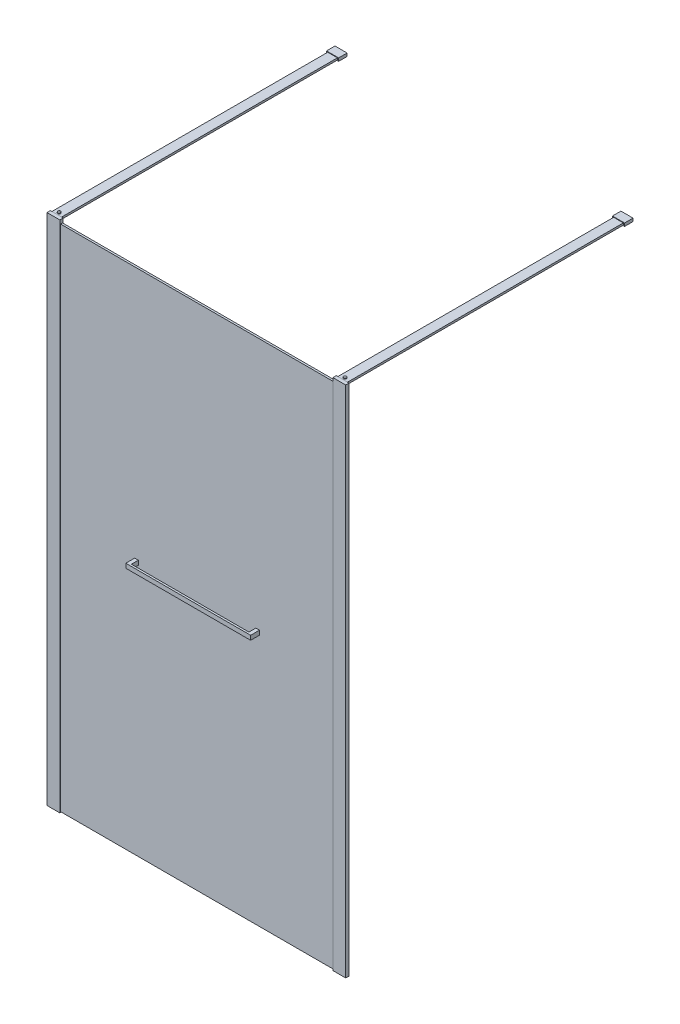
ISO-10303-21;
HEADER;
FILE_DESCRIPTION(('STEP AP214'),'2;1');
FILE_NAME('part.step','',(''),(''),'','','');
FILE_SCHEMA(('AUTOMOTIVE_DESIGN { 1 0 10303 214 1 1 1 1 }'));
ENDSEC;
DATA;
#1=APPLICATION_CONTEXT('core data for automotive mechanical design processes');
#2=APPLICATION_PROTOCOL_DEFINITION('international standard','automotive_design',2000,#1);
#3=PRODUCT_CONTEXT('',#1,'mechanical');
#4=PRODUCT('Part','Part','',(#3));
#5=PRODUCT_RELATED_PRODUCT_CATEGORY('part','',(#4));
#6=PRODUCT_DEFINITION_FORMATION('','',#4);
#7=PRODUCT_DEFINITION_CONTEXT('part definition',#1,'design');
#8=PRODUCT_DEFINITION('design','',#6,#7);
#9=PRODUCT_DEFINITION_SHAPE('','',#8);
#10=(LENGTH_UNIT() NAMED_UNIT(*) SI_UNIT(.MILLI.,.METRE.));
#11=(NAMED_UNIT(*) PLANE_ANGLE_UNIT() SI_UNIT($,.RADIAN.));
#12=(NAMED_UNIT(*) SI_UNIT($,.STERADIAN.) SOLID_ANGLE_UNIT());
#13=UNCERTAINTY_MEASURE_WITH_UNIT(LENGTH_MEASURE(1.E-05),#10,'distance_accuracy_value','');
#14=(GEOMETRIC_REPRESENTATION_CONTEXT(3) GLOBAL_UNCERTAINTY_ASSIGNED_CONTEXT((#13)) GLOBAL_UNIT_ASSIGNED_CONTEXT((#10,
#11,#12)) REPRESENTATION_CONTEXT('',''));
#15=CARTESIAN_POINT('',(0.,0.,0.));
#16=DIRECTION('',(0.,0.,1.));
#17=DIRECTION('',(1.,0.,0.));
#18=AXIS2_PLACEMENT_3D('',#15,#16,#17);
#19=CARTESIAN_POINT('',(373.9,1062.,-21.));
#20=DIRECTION('',(1.,0.,0.));
#21=DIRECTION('',(0.,0.,-1.));
#22=AXIS2_PLACEMENT_3D('',#19,#20,#21);
#23=PLANE('',#22);
#24=DIRECTION('',(0.,1.,0.));
#25=VECTOR('',#24,1.);
#26=CARTESIAN_POINT('',(373.9,1062.,25.5));
#27=LINE('',#26,#25);
#28=CARTESIAN_POINT('',(373.9,1044.,25.5));
#29=VERTEX_POINT('',#28);
#30=CARTESIAN_POINT('',(373.9,1062.,25.5));
#31=VERTEX_POINT('',#30);
#32=EDGE_CURVE('E63',#29,#31,#27,.T.);
#33=ORIENTED_EDGE('',*,*,#32,.F.);
#34=DIRECTION('',(0.,0.,1.));
#35=VECTOR('',#34,1.);
#36=CARTESIAN_POINT('',(373.9,1044.,-21.));
#37=LINE('',#36,#35);
#38=CARTESIAN_POINT('',(373.9,1044.,-21.));
#39=VERTEX_POINT('',#38);
#40=EDGE_CURVE('E12',#39,#29,#37,.T.);
#41=ORIENTED_EDGE('',*,*,#40,.F.);
#42=DIRECTION('',(0.,1.,0.));
#43=VECTOR('',#42,1.);
#44=CARTESIAN_POINT('',(373.9,1062.,-21.));
#45=LINE('',#44,#43);
#46=CARTESIAN_POINT('',(373.9,1062.,-21.));
#47=VERTEX_POINT('',#46);
#48=EDGE_CURVE('E193',#39,#47,#45,.T.);
#49=ORIENTED_EDGE('',*,*,#48,.T.);
#50=DIRECTION('',(0.,0.,1.));
#51=VECTOR('',#50,1.);
#52=CARTESIAN_POINT('',(373.9,1062.,-21.));
#53=LINE('',#52,#51);
#54=EDGE_CURVE('E176',#47,#31,#53,.T.);
#55=ORIENTED_EDGE('',*,*,#54,.T.);
#56=EDGE_LOOP('',(#33,#41,#49,#55));
#57=FACE_BOUND('',#56,.T.);
#58=ADVANCED_FACE('F46',(#57),#23,.T.);
#59=CARTESIAN_POINT('',(358.9,1044.,-21.));
#60=DIRECTION('',(0.,-1.,0.));
#61=DIRECTION('',(0.,0.,-1.));
#62=AXIS2_PLACEMENT_3D('',#59,#60,#61);
#63=PLANE('',#62);
#64=ORIENTED_EDGE('',*,*,#40,.T.);
#65=DIRECTION('',(-1.,0.,0.));
#66=VECTOR('',#65,1.);
#67=CARTESIAN_POINT('',(878.597715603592,1044.,25.5));
#68=LINE('',#67,#66);
#69=CARTESIAN_POINT('',(858.9,1044.,25.5));
#70=VERTEX_POINT('',#69);
#71=EDGE_CURVE('E166',#70,#29,#68,.T.);
#72=ORIENTED_EDGE('',*,*,#71,.F.);
#73=DIRECTION('',(0.,0.,1.));
#74=VECTOR('',#73,1.);
#75=CARTESIAN_POINT('',(858.9,1044.,-21.));
#76=LINE('',#75,#74);
#77=CARTESIAN_POINT('',(858.9,1044.,-21.));
#78=VERTEX_POINT('',#77);
#79=EDGE_CURVE('E149',#78,#70,#76,.T.);
#80=ORIENTED_EDGE('',*,*,#79,.F.);
#81=DIRECTION('',(1.,0.,0.));
#82=VECTOR('',#81,1.);
#83=CARTESIAN_POINT('',(858.9,1044.,-21.));
#84=LINE('',#83,#82);
#85=CARTESIAN_POINT('',(873.9,1044.,-21.));
#86=VERTEX_POINT('',#85);
#87=EDGE_CURVE('E131',#78,#86,#84,.T.);
#88=ORIENTED_EDGE('',*,*,#87,.T.);
#89=DIRECTION('',(0.,0.,1.));
#90=VECTOR('',#89,1.);
#91=CARTESIAN_POINT('',(873.9,1044.,-21.));
#92=LINE('',#91,#90);
#93=CARTESIAN_POINT('',(873.9,1044.,33.5));
#94=VERTEX_POINT('',#93);
#95=EDGE_CURVE('E147',#86,#94,#92,.T.);
#96=ORIENTED_EDGE('',*,*,#95,.T.);
#97=DIRECTION('',(1.,0.,0.));
#98=VECTOR('',#97,1.);
#99=CARTESIAN_POINT('',(358.9,1044.,33.5));
#100=LINE('',#99,#98);
#101=CARTESIAN_POINT('',(358.9,1044.,33.5));
#102=VERTEX_POINT('',#101);
#103=EDGE_CURVE('E135',#102,#94,#100,.T.);
#104=ORIENTED_EDGE('',*,*,#103,.F.);
#105=DIRECTION('',(0.,0.,1.));
#106=VECTOR('',#105,1.);
#107=CARTESIAN_POINT('',(358.9,1044.,-21.));
#108=LINE('',#107,#106);
#109=CARTESIAN_POINT('',(358.9,1044.,-21.));
#110=VERTEX_POINT('',#109);
#111=EDGE_CURVE('E55',#110,#102,#108,.T.);
#112=ORIENTED_EDGE('',*,*,#111,.F.);
#113=DIRECTION('',(1.,0.,0.));
#114=VECTOR('',#113,1.);
#115=CARTESIAN_POINT('',(358.9,1044.,-21.));
#116=LINE('',#115,#114);
#117=EDGE_CURVE('E181',#110,#39,#116,.T.);
#118=ORIENTED_EDGE('',*,*,#117,.T.);
#119=EDGE_LOOP('',(#64,#72,#80,#88,#96,#104,#112,#118));
#120=FACE_BOUND('',#119,.T.);
#121=ADVANCED_FACE('F197',(#120),#63,.T.);
#122=CARTESIAN_POINT('',(358.9,1062.,-21.));
#123=DIRECTION('',(-1.,0.,0.));
#124=DIRECTION('',(0.,0.,1.));
#125=AXIS2_PLACEMENT_3D('',#122,#123,#124);
#126=PLANE('',#125);
#127=ORIENTED_EDGE('',*,*,#111,.T.);
#128=DIRECTION('',(0.,-1.,0.));
#129=VECTOR('',#128,1.);
#130=CARTESIAN_POINT('',(358.9,1062.,33.5));
#131=LINE('',#130,#129);
#132=CARTESIAN_POINT('',(358.9,1062.,33.5));
#133=VERTEX_POINT('',#132);
#134=EDGE_CURVE('E121',#133,#102,#131,.T.);
#135=ORIENTED_EDGE('',*,*,#134,.F.);
#136=DIRECTION('',(0.,0.,1.));
#137=VECTOR('',#136,1.);
#138=CARTESIAN_POINT('',(358.9,1062.,-21.));
#139=LINE('',#138,#137);
#140=CARTESIAN_POINT('',(358.9,1062.,-21.));
#141=VERTEX_POINT('',#140);
#142=EDGE_CURVE('E116',#141,#133,#139,.T.);
#143=ORIENTED_EDGE('',*,*,#142,.F.);
#144=DIRECTION('',(0.,-1.,0.));
#145=VECTOR('',#144,1.);
#146=CARTESIAN_POINT('',(358.9,1062.,-21.));
#147=LINE('',#146,#145);
#148=EDGE_CURVE('E186',#141,#110,#147,.T.);
#149=ORIENTED_EDGE('',*,*,#148,.T.);
#150=EDGE_LOOP('',(#127,#135,#143,#149));
#151=FACE_BOUND('',#150,.T.);
#152=ADVANCED_FACE('F218',(#151),#126,.T.);
#153=CARTESIAN_POINT('',(358.9,1062.,-21.));
#154=DIRECTION('',(0.,1.,0.));
#155=DIRECTION('',(0.,0.,1.));
#156=AXIS2_PLACEMENT_3D('',#153,#154,#155);
#157=PLANE('',#156);
#158=ORIENTED_EDGE('',*,*,#142,.T.);
#159=DIRECTION('',(-1.,0.,0.));
#160=VECTOR('',#159,1.);
#161=CARTESIAN_POINT('',(358.9,1062.,33.5));
#162=LINE('',#161,#160);
#163=CARTESIAN_POINT('',(873.9,1062.,33.5));
#164=VERTEX_POINT('',#163);
#165=EDGE_CURVE('E109',#164,#133,#162,.T.);
#166=ORIENTED_EDGE('',*,*,#165,.F.);
#167=DIRECTION('',(0.,0.,1.));
#168=VECTOR('',#167,1.);
#169=CARTESIAN_POINT('',(873.9,1062.,-21.));
#170=LINE('',#169,#168);
#171=CARTESIAN_POINT('',(873.9,1062.,-21.));
#172=VERTEX_POINT('',#171);
#173=EDGE_CURVE('E113',#172,#164,#170,.T.);
#174=ORIENTED_EDGE('',*,*,#173,.F.);
#175=DIRECTION('',(-1.,0.,0.));
#176=VECTOR('',#175,1.);
#177=CARTESIAN_POINT('',(858.9,1062.,-21.));
#178=LINE('',#177,#176);
#179=CARTESIAN_POINT('',(858.9,1062.,-21.));
#180=VERTEX_POINT('',#179);
#181=EDGE_CURVE('E138',#172,#180,#178,.T.);
#182=ORIENTED_EDGE('',*,*,#181,.T.);
#183=DIRECTION('',(0.,0.,1.));
#184=VECTOR('',#183,1.);
#185=CARTESIAN_POINT('',(858.9,1062.,-21.));
#186=LINE('',#185,#184);
#187=CARTESIAN_POINT('',(858.9,1062.,25.5));
#188=VERTEX_POINT('',#187);
#189=EDGE_CURVE('E130',#180,#188,#186,.T.);
#190=ORIENTED_EDGE('',*,*,#189,.T.);
#191=DIRECTION('',(-1.,0.,0.));
#192=VECTOR('',#191,1.);
#193=CARTESIAN_POINT('',(878.597715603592,1062.,25.5));
#194=LINE('',#193,#192);
#195=EDGE_CURVE('E163',#188,#31,#194,.T.);
#196=ORIENTED_EDGE('',*,*,#195,.T.);
#197=ORIENTED_EDGE('',*,*,#54,.F.);
#198=DIRECTION('',(-1.,0.,0.));
#199=VECTOR('',#198,1.);
#200=CARTESIAN_POINT('',(358.9,1062.,-21.));
#201=LINE('',#200,#199);
#202=EDGE_CURVE('E190',#47,#141,#201,.T.);
#203=ORIENTED_EDGE('',*,*,#202,.T.);
#204=EDGE_LOOP('',(#158,#166,#174,#182,#190,#196,#197,#203));
#205=FACE_BOUND('',#204,.T.);
#206=ADVANCED_FACE('F111',(#205),#157,.T.);
#207=CARTESIAN_POINT('',(373.9,1044.,-21.));
#208=DIRECTION('',(0.,0.,1.));
#209=DIRECTION('',(1.,0.,0.));
#210=AXIS2_PLACEMENT_3D('',#207,#208,#209);
#211=PLANE('',#210);
#212=ORIENTED_EDGE('',*,*,#48,.F.);
#213=ORIENTED_EDGE('',*,*,#117,.F.);
#214=ORIENTED_EDGE('',*,*,#148,.F.);
#215=ORIENTED_EDGE('',*,*,#202,.F.);
#216=EDGE_LOOP('',(#212,#213,#214,#215));
#217=FACE_BOUND('',#216,.T.);
#218=ADVANCED_FACE('F225',(#217),#211,.F.);
#219=CARTESIAN_POINT('',(373.9,1044.,33.5));
#220=DIRECTION('',(0.,0.,1.));
#221=DIRECTION('',(1.,0.,0.));
#222=AXIS2_PLACEMENT_3D('',#219,#220,#221);
#223=PLANE('',#222);
#224=ORIENTED_EDGE('',*,*,#103,.T.);
#225=DIRECTION('',(0.,1.,0.));
#226=VECTOR('',#225,1.);
#227=CARTESIAN_POINT('',(873.9,1062.,33.5));
#228=LINE('',#227,#226);
#229=EDGE_CURVE('E127',#94,#164,#228,.T.);
#230=ORIENTED_EDGE('',*,*,#229,.T.);
#231=ORIENTED_EDGE('',*,*,#165,.T.);
#232=ORIENTED_EDGE('',*,*,#134,.T.);
#233=EDGE_LOOP('',(#224,#230,#231,#232));
#234=FACE_BOUND('',#233,.T.);
#235=ADVANCED_FACE('F133',(#234),#223,.T.);
#236=CARTESIAN_POINT('',(878.597715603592,1062.,25.5));
#237=DIRECTION('',(0.,0.,1.));
#238=DIRECTION('',(1.,0.,0.));
#239=AXIS2_PLACEMENT_3D('',#236,#237,#238);
#240=PLANE('',#239);
#241=ORIENTED_EDGE('',*,*,#195,.F.);
#242=DIRECTION('',(0.,-1.,0.));
#243=VECTOR('',#242,1.);
#244=CARTESIAN_POINT('',(858.9,1062.,25.5));
#245=LINE('',#244,#243);
#246=EDGE_CURVE('E49',#188,#70,#245,.T.);
#247=ORIENTED_EDGE('',*,*,#246,.T.);
#248=ORIENTED_EDGE('',*,*,#71,.T.);
#249=ORIENTED_EDGE('',*,*,#32,.T.);
#250=EDGE_LOOP('',(#241,#247,#248,#249));
#251=FACE_BOUND('',#250,.T.);
#252=ADVANCED_FACE('F203',(#251),#240,.F.);
#253=CARTESIAN_POINT('',(858.9,1062.,-21.));
#254=DIRECTION('',(-1.,0.,0.));
#255=DIRECTION('',(0.,0.,1.));
#256=AXIS2_PLACEMENT_3D('',#253,#254,#255);
#257=PLANE('',#256);
#258=ORIENTED_EDGE('',*,*,#246,.F.);
#259=ORIENTED_EDGE('',*,*,#189,.F.);
#260=DIRECTION('',(0.,-1.,0.));
#261=VECTOR('',#260,1.);
#262=CARTESIAN_POINT('',(858.9,1062.,-21.));
#263=LINE('',#262,#261);
#264=EDGE_CURVE('E142',#180,#78,#263,.T.);
#265=ORIENTED_EDGE('',*,*,#264,.T.);
#266=ORIENTED_EDGE('',*,*,#79,.T.);
#267=EDGE_LOOP('',(#258,#259,#265,#266));
#268=FACE_BOUND('',#267,.T.);
#269=ADVANCED_FACE('F204',(#268),#257,.T.);
#270=CARTESIAN_POINT('',(873.9,1062.,-21.));
#271=DIRECTION('',(1.,0.,0.));
#272=DIRECTION('',(0.,0.,-1.));
#273=AXIS2_PLACEMENT_3D('',#270,#271,#272);
#274=PLANE('',#273);
#275=ORIENTED_EDGE('',*,*,#173,.T.);
#276=ORIENTED_EDGE('',*,*,#229,.F.);
#277=ORIENTED_EDGE('',*,*,#95,.F.);
#278=DIRECTION('',(0.,1.,0.));
#279=VECTOR('',#278,1.);
#280=CARTESIAN_POINT('',(873.9,1062.,-21.));
#281=LINE('',#280,#279);
#282=EDGE_CURVE('E129',#86,#172,#281,.T.);
#283=ORIENTED_EDGE('',*,*,#282,.T.);
#284=EDGE_LOOP('',(#275,#276,#277,#283));
#285=FACE_BOUND('',#284,.T.);
#286=ADVANCED_FACE('F126',(#285),#274,.T.);
#287=CARTESIAN_POINT('',(873.9,1044.,-21.));
#288=DIRECTION('',(0.,0.,1.));
#289=DIRECTION('',(1.,0.,0.));
#290=AXIS2_PLACEMENT_3D('',#287,#288,#289);
#291=PLANE('',#290);
#292=ORIENTED_EDGE('',*,*,#282,.F.);
#293=ORIENTED_EDGE('',*,*,#87,.F.);
#294=ORIENTED_EDGE('',*,*,#264,.F.);
#295=ORIENTED_EDGE('',*,*,#181,.F.);
#296=EDGE_LOOP('',(#292,#293,#294,#295));
#297=FACE_BOUND('',#296,.T.);
#298=ADVANCED_FACE('F200',(#297),#291,.F.);
#299=CLOSED_SHELL('',(#58,#121,#152,#206,#218,#235,#252,#269,#286,#298));
#300=MANIFOLD_SOLID_BREP('B2',#299);
#301=CARTESIAN_POINT('',(46.5000000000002,2119.,-1184.));
#302=DIRECTION('',(-1.,0.,0.));
#303=DIRECTION('',(0.,0.,1.));
#304=AXIS2_PLACEMENT_3D('',#301,#302,#303);
#305=PLANE('',#304);
#306=DIRECTION('',(0.,-1.,0.));
#307=VECTOR('',#306,1.);
#308=CARTESIAN_POINT('',(46.5000000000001,2119.,-1152.));
#309=LINE('',#308,#307);
#310=CARTESIAN_POINT('',(46.5000000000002,2119.,-1152.));
#311=VERTEX_POINT('',#310);
#312=CARTESIAN_POINT('',(46.5000000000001,2111.,-1152.));
#313=VERTEX_POINT('',#312);
#314=EDGE_CURVE('E417',#311,#313,#309,.T.);
#315=ORIENTED_EDGE('',*,*,#314,.F.);
#316=DIRECTION('',(0.,0.,1.));
#317=VECTOR('',#316,1.);
#318=CARTESIAN_POINT('',(46.5000000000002,2119.,-1184.));
#319=LINE('',#318,#317);
#320=CARTESIAN_POINT('',(46.5,2119.,-14.));
#321=VERTEX_POINT('',#320);
#322=EDGE_CURVE('E432',#311,#321,#319,.T.);
#323=ORIENTED_EDGE('',*,*,#322,.T.);
#324=DIRECTION('',(0.,-1.,0.));
#325=VECTOR('',#324,1.);
#326=CARTESIAN_POINT('',(46.5,2119.,-14.));
#327=LINE('',#326,#325);
#328=CARTESIAN_POINT('',(46.5,2111.,-14.));
#329=VERTEX_POINT('',#328);
#330=EDGE_CURVE('E420',#321,#329,#327,.T.);
#331=ORIENTED_EDGE('',*,*,#330,.T.);
#332=DIRECTION('',(0.,0.,1.));
#333=VECTOR('',#332,1.);
#334=CARTESIAN_POINT('',(46.5000000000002,2111.,-1184.));
#335=LINE('',#334,#333);
#336=EDGE_CURVE('E327',#313,#329,#335,.T.);
#337=ORIENTED_EDGE('',*,*,#336,.F.);
#338=EDGE_LOOP('',(#315,#323,#331,#337));
#339=FACE_BOUND('',#338,.T.);
#340=ADVANCED_FACE('F319',(#339),#305,.F.);
#341=CARTESIAN_POINT('',(46.5000000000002,2111.,-1184.));
#342=DIRECTION('',(0.,1.,0.));
#343=DIRECTION('',(0.,0.,1.));
#344=AXIS2_PLACEMENT_3D('',#341,#342,#343);
#345=PLANE('',#344);
#346=DIRECTION('',(-1.,0.,0.));
#347=VECTOR('',#346,1.);
#348=CARTESIAN_POINT('',(46.5000000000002,2111.,-1152.));
#349=LINE('',#348,#347);
#350=CARTESIAN_POINT('',(6.50000000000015,2111.,-1152.));
#351=VERTEX_POINT('',#350);
#352=EDGE_CURVE('E334',#313,#351,#349,.T.);
#353=ORIENTED_EDGE('',*,*,#352,.F.);
#354=ORIENTED_EDGE('',*,*,#336,.T.);
#355=DIRECTION('',(-1.,0.,0.));
#356=VECTOR('',#355,1.);
#357=CARTESIAN_POINT('',(46.5,2111.,-14.));
#358=LINE('',#357,#356);
#359=CARTESIAN_POINT('',(6.5,2111.,-14.));
#360=VERTEX_POINT('',#359);
#361=EDGE_CURVE('E423',#329,#360,#358,.T.);
#362=ORIENTED_EDGE('',*,*,#361,.T.);
#363=DIRECTION('',(0.,0.,1.));
#364=VECTOR('',#363,1.);
#365=CARTESIAN_POINT('',(6.50000000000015,2111.,-1184.));
#366=LINE('',#365,#364);
#367=EDGE_CURVE('E436',#351,#360,#366,.T.);
#368=ORIENTED_EDGE('',*,*,#367,.F.);
#369=EDGE_LOOP('',(#353,#354,#362,#368));
#370=FACE_BOUND('',#369,.T.);
#371=ADVANCED_FACE('F438',(#370),#345,.F.);
#372=CARTESIAN_POINT('',(6.50000000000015,2119.,-1184.));
#373=DIRECTION('',(1.,0.,0.));
#374=DIRECTION('',(0.,0.,-1.));
#375=AXIS2_PLACEMENT_3D('',#372,#373,#374);
#376=PLANE('',#375);
#377=DIRECTION('',(0.,1.,0.));
#378=VECTOR('',#377,1.);
#379=CARTESIAN_POINT('',(6.50000000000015,2119.,-1152.));
#380=LINE('',#379,#378);
#381=CARTESIAN_POINT('',(6.50000000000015,2119.,-1152.));
#382=VERTEX_POINT('',#381);
#383=EDGE_CURVE('E342',#351,#382,#380,.T.);
#384=ORIENTED_EDGE('',*,*,#383,.F.);
#385=ORIENTED_EDGE('',*,*,#367,.T.);
#386=DIRECTION('',(0.,1.,0.));
#387=VECTOR('',#386,1.);
#388=CARTESIAN_POINT('',(6.5,2119.,-14.));
#389=LINE('',#388,#387);
#390=CARTESIAN_POINT('',(6.5,2119.,-14.));
#391=VERTEX_POINT('',#390);
#392=EDGE_CURVE('E426',#360,#391,#389,.T.);
#393=ORIENTED_EDGE('',*,*,#392,.T.);
#394=DIRECTION('',(0.,0.,1.));
#395=VECTOR('',#394,1.);
#396=CARTESIAN_POINT('',(6.50000000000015,2119.,-1184.));
#397=LINE('',#396,#395);
#398=EDGE_CURVE('E434',#382,#391,#397,.T.);
#399=ORIENTED_EDGE('',*,*,#398,.F.);
#400=EDGE_LOOP('',(#384,#385,#393,#399));
#401=FACE_BOUND('',#400,.T.);
#402=ADVANCED_FACE('F448',(#401),#376,.F.);
#403=CARTESIAN_POINT('',(46.5000000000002,2119.,-1184.));
#404=DIRECTION('',(0.,-1.,0.));
#405=DIRECTION('',(0.,0.,-1.));
#406=AXIS2_PLACEMENT_3D('',#403,#404,#405);
#407=PLANE('',#406);
#408=CARTESIAN_POINT('',(26.5,2119.,-24.));
#409=DIRECTION('',(0.,-1.,0.));
#410=DIRECTION('',(0.,0.,-1.));
#411=AXIS2_PLACEMENT_3D('',#408,#409,#410);
#412=CIRCLE('',#411,5.89999999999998);
#413=CARTESIAN_POINT('',(26.5,2119.,-29.9));
#414=VERTEX_POINT('',#413);
#415=EDGE_CURVE('E511',#414,#414,#412,.T.);
#416=ORIENTED_EDGE('',*,*,#415,.T.);
#417=EDGE_LOOP('',(#416));
#418=FACE_BOUND('',#417,.T.);
#419=DIRECTION('',(1.,0.,0.));
#420=VECTOR('',#419,1.);
#421=CARTESIAN_POINT('',(46.5000000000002,2119.,-1152.));
#422=LINE('',#421,#420);
#423=EDGE_CURVE('E44',#382,#311,#422,.T.);
#424=ORIENTED_EDGE('',*,*,#423,.F.);
#425=ORIENTED_EDGE('',*,*,#398,.T.);
#426=DIRECTION('',(1.,0.,0.));
#427=VECTOR('',#426,1.);
#428=CARTESIAN_POINT('',(46.5,2119.,-14.));
#429=LINE('',#428,#427);
#430=EDGE_CURVE('E429',#391,#321,#429,.T.);
#431=ORIENTED_EDGE('',*,*,#430,.T.);
#432=ORIENTED_EDGE('',*,*,#322,.F.);
#433=EDGE_LOOP('',(#424,#425,#431,#432));
#434=FACE_BOUND('',#433,.T.);
#435=ADVANCED_FACE('F447',(#418,#434),#407,.F.);
#436=CARTESIAN_POINT('',(46.5,2111.,-14.));
#437=DIRECTION('',(0.,0.,-1.));
#438=DIRECTION('',(-1.,0.,0.));
#439=AXIS2_PLACEMENT_3D('',#436,#437,#438);
#440=PLANE('',#439);
#441=ORIENTED_EDGE('',*,*,#330,.F.);
#442=ORIENTED_EDGE('',*,*,#430,.F.);
#443=ORIENTED_EDGE('',*,*,#392,.F.);
#444=ORIENTED_EDGE('',*,*,#361,.F.);
#445=EDGE_LOOP('',(#441,#442,#443,#444));
#446=FACE_BOUND('',#445,.T.);
#447=ADVANCED_FACE('F444',(#446),#440,.F.);
#448=CARTESIAN_POINT('',(1.50000000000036,2108.75,-1152.));
#449=DIRECTION('',(0.,0.,-1.));
#450=DIRECTION('',(-1.,0.,0.));
#451=AXIS2_PLACEMENT_3D('',#448,#449,#450);
#452=PLANE('',#451);
#453=DIRECTION('',(0.,1.,0.));
#454=VECTOR('',#453,1.);
#455=CARTESIAN_POINT('',(1.50000000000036,2121.25,-1152.));
#456=LINE('',#455,#454);
#457=CARTESIAN_POINT('',(1.50000000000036,2108.75,-1152.));
#458=VERTEX_POINT('',#457);
#459=CARTESIAN_POINT('',(1.50000000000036,2121.25,-1152.));
#460=VERTEX_POINT('',#459);
#461=EDGE_CURVE('E409',#458,#460,#456,.T.);
#462=ORIENTED_EDGE('',*,*,#461,.F.);
#463=DIRECTION('',(-1.,0.,0.));
#464=VECTOR('',#463,1.);
#465=CARTESIAN_POINT('',(51.5000000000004,2108.75,-1152.));
#466=LINE('',#465,#464);
#467=CARTESIAN_POINT('',(51.5000000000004,2108.75,-1152.));
#468=VERTEX_POINT('',#467);
#469=EDGE_CURVE('E405',#468,#458,#466,.T.);
#470=ORIENTED_EDGE('',*,*,#469,.F.);
#471=DIRECTION('',(0.,-1.,0.));
#472=VECTOR('',#471,1.);
#473=CARTESIAN_POINT('',(51.5000000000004,2121.25,-1152.));
#474=LINE('',#473,#472);
#475=CARTESIAN_POINT('',(51.5000000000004,2121.25,-1152.));
#476=VERTEX_POINT('',#475);
#477=EDGE_CURVE('E492',#476,#468,#474,.T.);
#478=ORIENTED_EDGE('',*,*,#477,.F.);
#479=DIRECTION('',(1.,0.,0.));
#480=VECTOR('',#479,1.);
#481=CARTESIAN_POINT('',(51.5000000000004,2121.25,-1152.));
#482=LINE('',#481,#480);
#483=EDGE_CURVE('E495',#460,#476,#482,.T.);
#484=ORIENTED_EDGE('',*,*,#483,.F.);
#485=EDGE_LOOP('',(#462,#470,#478,#484));
#486=FACE_BOUND('',#485,.T.);
#487=ORIENTED_EDGE('',*,*,#423,.T.);
#488=ORIENTED_EDGE('',*,*,#314,.T.);
#489=ORIENTED_EDGE('',*,*,#352,.T.);
#490=ORIENTED_EDGE('',*,*,#383,.T.);
#491=EDGE_LOOP('',(#487,#488,#489,#490));
#492=FACE_BOUND('',#491,.T.);
#493=ADVANCED_FACE('F450',(#486,#492),#452,.F.);
#494=CARTESIAN_POINT('',(1.50000000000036,2121.25,-1187.));
#495=DIRECTION('',(1.,0.,0.));
#496=DIRECTION('',(0.,0.,-1.));
#497=AXIS2_PLACEMENT_3D('',#494,#495,#496);
#498=PLANE('',#497);
#499=ORIENTED_EDGE('',*,*,#461,.T.);
#500=DIRECTION('',(0.,0.,1.));
#501=VECTOR('',#500,1.);
#502=CARTESIAN_POINT('',(1.50000000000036,2121.25,-1187.));
#503=LINE('',#502,#501);
#504=CARTESIAN_POINT('',(1.50000000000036,2121.25,-1187.));
#505=VERTEX_POINT('',#504);
#506=EDGE_CURVE('E389',#505,#460,#503,.T.);
#507=ORIENTED_EDGE('',*,*,#506,.F.);
#508=DIRECTION('',(0.,1.,0.));
#509=VECTOR('',#508,1.);
#510=CARTESIAN_POINT('',(1.50000000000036,2121.25,-1187.));
#511=LINE('',#510,#509);
#512=CARTESIAN_POINT('',(1.50000000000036,2108.75,-1187.));
#513=VERTEX_POINT('',#512);
#514=EDGE_CURVE('E396',#513,#505,#511,.T.);
#515=ORIENTED_EDGE('',*,*,#514,.F.);
#516=DIRECTION('',(0.,0.,1.));
#517=VECTOR('',#516,1.);
#518=CARTESIAN_POINT('',(1.50000000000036,2108.75,-1187.));
#519=LINE('',#518,#517);
#520=EDGE_CURVE('E489',#513,#458,#519,.T.);
#521=ORIENTED_EDGE('',*,*,#520,.T.);
#522=EDGE_LOOP('',(#499,#507,#515,#521));
#523=FACE_BOUND('',#522,.T.);
#524=ADVANCED_FACE('F407',(#523),#498,.F.);
#525=CARTESIAN_POINT('',(51.5000000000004,2121.25,-1187.));
#526=DIRECTION('',(0.,-1.,0.));
#527=DIRECTION('',(0.,0.,-1.));
#528=AXIS2_PLACEMENT_3D('',#525,#526,#527);
#529=PLANE('',#528);
#530=ORIENTED_EDGE('',*,*,#483,.T.);
#531=DIRECTION('',(0.,0.,1.));
#532=VECTOR('',#531,1.);
#533=CARTESIAN_POINT('',(51.5000000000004,2121.25,-1187.));
#534=LINE('',#533,#532);
#535=CARTESIAN_POINT('',(51.5000000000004,2121.25,-1187.));
#536=VERTEX_POINT('',#535);
#537=EDGE_CURVE('E392',#536,#476,#534,.T.);
#538=ORIENTED_EDGE('',*,*,#537,.F.);
#539=DIRECTION('',(1.,0.,0.));
#540=VECTOR('',#539,1.);
#541=CARTESIAN_POINT('',(51.5000000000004,2121.25,-1187.));
#542=LINE('',#541,#540);
#543=EDGE_CURVE('E385',#505,#536,#542,.T.);
#544=ORIENTED_EDGE('',*,*,#543,.F.);
#545=ORIENTED_EDGE('',*,*,#506,.T.);
#546=EDGE_LOOP('',(#530,#538,#544,#545));
#547=FACE_BOUND('',#546,.T.);
#548=ADVANCED_FACE('F387',(#547),#529,.F.);
#549=CARTESIAN_POINT('',(51.5000000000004,2121.25,-1187.));
#550=DIRECTION('',(-1.,0.,0.));
#551=DIRECTION('',(0.,0.,1.));
#552=AXIS2_PLACEMENT_3D('',#549,#550,#551);
#553=PLANE('',#552);
#554=ORIENTED_EDGE('',*,*,#477,.T.);
#555=DIRECTION('',(0.,0.,1.));
#556=VECTOR('',#555,1.);
#557=CARTESIAN_POINT('',(51.5000000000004,2108.75,-1187.));
#558=LINE('',#557,#556);
#559=CARTESIAN_POINT('',(51.5000000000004,2108.75,-1187.));
#560=VERTEX_POINT('',#559);
#561=EDGE_CURVE('E412',#560,#468,#558,.T.);
#562=ORIENTED_EDGE('',*,*,#561,.F.);
#563=DIRECTION('',(0.,-1.,0.));
#564=VECTOR('',#563,1.);
#565=CARTESIAN_POINT('',(51.5000000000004,2121.25,-1187.));
#566=LINE('',#565,#564);
#567=EDGE_CURVE('E395',#536,#560,#566,.T.);
#568=ORIENTED_EDGE('',*,*,#567,.F.);
#569=ORIENTED_EDGE('',*,*,#537,.T.);
#570=EDGE_LOOP('',(#554,#562,#568,#569));
#571=FACE_BOUND('',#570,.T.);
#572=ADVANCED_FACE('F477',(#571),#553,.F.);
#573=CARTESIAN_POINT('',(51.5000000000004,2108.75,-1187.));
#574=DIRECTION('',(0.,1.,0.));
#575=DIRECTION('',(0.,0.,1.));
#576=AXIS2_PLACEMENT_3D('',#573,#574,#575);
#577=PLANE('',#576);
#578=ORIENTED_EDGE('',*,*,#469,.T.);
#579=ORIENTED_EDGE('',*,*,#520,.F.);
#580=DIRECTION('',(-1.,0.,0.));
#581=VECTOR('',#580,1.);
#582=CARTESIAN_POINT('',(51.5000000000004,2108.75,-1187.));
#583=LINE('',#582,#581);
#584=EDGE_CURVE('E401',#560,#513,#583,.T.);
#585=ORIENTED_EDGE('',*,*,#584,.F.);
#586=ORIENTED_EDGE('',*,*,#561,.T.);
#587=EDGE_LOOP('',(#578,#579,#585,#586));
#588=FACE_BOUND('',#587,.T.);
#589=ADVANCED_FACE('F479',(#588),#577,.F.);
#590=CARTESIAN_POINT('',(1.50000000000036,2108.75,-1187.));
#591=DIRECTION('',(0.,0.,-1.));
#592=DIRECTION('',(-1.,0.,0.));
#593=AXIS2_PLACEMENT_3D('',#590,#591,#592);
#594=PLANE('',#593);
#595=ORIENTED_EDGE('',*,*,#514,.T.);
#596=ORIENTED_EDGE('',*,*,#543,.T.);
#597=ORIENTED_EDGE('',*,*,#567,.T.);
#598=ORIENTED_EDGE('',*,*,#584,.T.);
#599=EDGE_LOOP('',(#595,#596,#597,#598));
#600=FACE_BOUND('',#599,.T.);
#601=ADVANCED_FACE('F399',(#600),#594,.T.);
#602=CARTESIAN_POINT('',(26.5,2115.34934210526,-24.));
#603=DIRECTION('',(0.,-1.,0.));
#604=DIRECTION('',(0.,0.,-1.));
#605=AXIS2_PLACEMENT_3D('',#602,#603,#604);
#606=SPHERICAL_SURFACE('',#605,9.35065789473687);
#607=CARTESIAN_POINT('',(26.5,2122.8,-24.));
#608=DIRECTION('',(0.,-1.,0.));
#609=DIRECTION('',(0.,0.,-1.));
#610=AXIS2_PLACEMENT_3D('',#607,#608,#609);
#611=CIRCLE('',#610,5.64999999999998);
#612=CARTESIAN_POINT('',(26.5,2122.8,-29.65));
#613=VERTEX_POINT('',#612);
#614=EDGE_CURVE('E508',#613,#613,#611,.T.);
#615=ORIENTED_EDGE('',*,*,#614,.F.);
#616=EDGE_LOOP('',(#615));
#617=FACE_BOUND('',#616,.T.);
#618=ADVANCED_FACE('F486',(#617),#606,.T.);
#619=CARTESIAN_POINT('',(26.5,2119.,-24.));
#620=DIRECTION('',(0.,-1.,0.));
#621=DIRECTION('',(0.,0.,-1.));
#622=AXIS2_PLACEMENT_3D('',#619,#620,#621);
#623=CONICAL_SURFACE('',#622,5.89999999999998,0.0656948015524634);
#624=ORIENTED_EDGE('',*,*,#614,.T.);
#625=EDGE_LOOP('',(#624));
#626=FACE_BOUND('',#625,.T.);
#627=ORIENTED_EDGE('',*,*,#415,.F.);
#628=EDGE_LOOP('',(#627));
#629=FACE_BOUND('',#628,.T.);
#630=ADVANCED_FACE('F515',(#626,#629),#623,.T.);
#631=CLOSED_SHELL('',(#340,#371,#402,#435,#447,#493,#524,#548,#572,#589,#601,#618,#630));
#632=CARTESIAN_POINT('',(26.5,2122.53567623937,-24.));
#633=DIRECTION('',(0.,-1.,0.));
#634=DIRECTION('',(0.,0.,-1.));
#635=AXIS2_PLACEMENT_3D('',#632,#633,#634);
#636=CONICAL_SURFACE('',#635,5.16630882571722,0.065694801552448);
#637=CARTESIAN_POINT('',(26.5,2119.,-24.));
#638=DIRECTION('',(0.,-1.,0.));
#639=DIRECTION('',(0.,0.,-1.));
#640=AXIS2_PLACEMENT_3D('',#637,#638,#639);
#641=CIRCLE('',#640,5.39891910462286);
#642=CARTESIAN_POINT('',(26.5,2119.,-29.3989191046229));
#643=VERTEX_POINT('',#642);
#644=EDGE_CURVE('E496',#643,#643,#641,.T.);
#645=ORIENTED_EDGE('',*,*,#644,.T.);
#646=EDGE_LOOP('',(#645));
#647=FACE_BOUND('',#646,.T.);
#648=CARTESIAN_POINT('',(26.5,2122.53567623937,-24.));
#649=DIRECTION('',(0.,-1.,0.));
#650=DIRECTION('',(0.,0.,-1.));
#651=AXIS2_PLACEMENT_3D('',#648,#649,#650);
#652=CIRCLE('',#651,5.16630882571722);
#653=CARTESIAN_POINT('',(26.5,2122.53567623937,-29.1663088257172));
#654=VERTEX_POINT('',#653);
#655=EDGE_CURVE('E500',#654,#654,#652,.T.);
#656=ORIENTED_EDGE('',*,*,#655,.F.);
#657=EDGE_LOOP('',(#656));
#658=FACE_BOUND('',#657,.T.);
#659=ADVANCED_FACE('F529',(#647,#658),#636,.F.);
#660=CARTESIAN_POINT('',(26.5,2115.34934210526,-24.));
#661=DIRECTION('',(0.,-1.,0.));
#662=DIRECTION('',(0.,0.,-1.));
#663=AXIS2_PLACEMENT_3D('',#660,#661,#662);
#664=SPHERICAL_SURFACE('',#663,8.85065789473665);
#665=ORIENTED_EDGE('',*,*,#655,.T.);
#666=EDGE_LOOP('',(#665));
#667=FACE_BOUND('',#666,.T.);
#668=ADVANCED_FACE('F526',(#667),#664,.F.);
#669=ORIENTED_EDGE('',*,*,#644,.F.);
#670=EDGE_LOOP('',(#669));
#671=FACE_BOUND('',#670,.T.);
#672=ADVANCED_FACE('F473',(#671),#407,.F.);
#673=CLOSED_SHELL('',(#659,#668,#672));
#674=ORIENTED_CLOSED_SHELL('',*,#673,.T.);
#675=BREP_WITH_VOIDS('B6',#631,(#674));
#676=CARTESIAN_POINT('',(1226.3,2119.,-1184.));
#677=DIRECTION('',(0.,-1.,0.));
#678=DIRECTION('',(0.,0.,-1.));
#679=AXIS2_PLACEMENT_3D('',#676,#677,#678);
#680=PLANE('',#679);
#681=CARTESIAN_POINT('',(1206.3,2119.,-23.9999999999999));
#682=DIRECTION('',(0.,-1.,0.));
#683=DIRECTION('',(0.,0.,-1.));
#684=AXIS2_PLACEMENT_3D('',#681,#682,#683);
#685=CIRCLE('',#684,5.89999999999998);
#686=CARTESIAN_POINT('',(1206.3,2119.,-29.8999999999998));
#687=VERTEX_POINT('',#686);
#688=EDGE_CURVE('E814',#687,#687,#685,.T.);
#689=ORIENTED_EDGE('',*,*,#688,.T.);
#690=EDGE_LOOP('',(#689));
#691=FACE_BOUND('',#690,.T.);
#692=DIRECTION('',(1.,0.,0.));
#693=VECTOR('',#692,1.);
#694=CARTESIAN_POINT('',(1226.3,2119.,-1152.));
#695=LINE('',#694,#693);
#696=CARTESIAN_POINT('',(1186.3,2119.,-1152.));
#697=VERTEX_POINT('',#696);
#698=CARTESIAN_POINT('',(1226.3,2119.,-1152.));
#699=VERTEX_POINT('',#698);
#700=EDGE_CURVE('E316',#697,#699,#695,.T.);
#701=ORIENTED_EDGE('',*,*,#700,.F.);
#702=DIRECTION('',(0.,0.,1.));
#703=VECTOR('',#702,1.);
#704=CARTESIAN_POINT('',(1186.3,2119.,-1184.));
#705=LINE('',#704,#703);
#706=CARTESIAN_POINT('',(1186.3,2119.,-13.9999999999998));
#707=VERTEX_POINT('',#706);
#708=EDGE_CURVE('E755',#697,#707,#705,.T.);
#709=ORIENTED_EDGE('',*,*,#708,.T.);
#710=DIRECTION('',(1.,0.,0.));
#711=VECTOR('',#710,1.);
#712=CARTESIAN_POINT('',(1226.3,2119.,-13.9999999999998));
#713=LINE('',#712,#711);
#714=CARTESIAN_POINT('',(1226.3,2119.,-13.9999999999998));
#715=VERTEX_POINT('',#714);
#716=EDGE_CURVE('E750',#707,#715,#713,.T.);
#717=ORIENTED_EDGE('',*,*,#716,.T.);
#718=DIRECTION('',(0.,0.,1.));
#719=VECTOR('',#718,1.);
#720=CARTESIAN_POINT('',(1226.3,2119.,-1184.));
#721=LINE('',#720,#719);
#722=EDGE_CURVE('E753',#699,#715,#721,.T.);
#723=ORIENTED_EDGE('',*,*,#722,.F.);
#724=EDGE_LOOP('',(#701,#709,#717,#723));
#725=FACE_BOUND('',#724,.T.);
#726=ADVANCED_FACE('F639',(#691,#725),#680,.F.);
#727=CARTESIAN_POINT('',(1226.3,2119.,-1184.));
#728=DIRECTION('',(-1.,0.,0.));
#729=DIRECTION('',(0.,0.,1.));
#730=AXIS2_PLACEMENT_3D('',#727,#728,#729);
#731=PLANE('',#730);
#732=DIRECTION('',(0.,-1.,0.));
#733=VECTOR('',#732,1.);
#734=CARTESIAN_POINT('',(1226.3,2119.,-1152.));
#735=LINE('',#734,#733);
#736=CARTESIAN_POINT('',(1226.3,2111.,-1152.));
#737=VERTEX_POINT('',#736);
#738=EDGE_CURVE('E738',#699,#737,#735,.T.);
#739=ORIENTED_EDGE('',*,*,#738,.F.);
#740=ORIENTED_EDGE('',*,*,#722,.T.);
#741=DIRECTION('',(0.,-1.,0.));
#742=VECTOR('',#741,1.);
#743=CARTESIAN_POINT('',(1226.3,2119.,-13.9999999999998));
#744=LINE('',#743,#742);
#745=CARTESIAN_POINT('',(1226.3,2111.,-13.9999999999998));
#746=VERTEX_POINT('',#745);
#747=EDGE_CURVE('E741',#715,#746,#744,.T.);
#748=ORIENTED_EDGE('',*,*,#747,.T.);
#749=DIRECTION('',(0.,0.,1.));
#750=VECTOR('',#749,1.);
#751=CARTESIAN_POINT('',(1226.3,2111.,-1184.));
#752=LINE('',#751,#750);
#753=EDGE_CURVE('E648',#737,#746,#752,.T.);
#754=ORIENTED_EDGE('',*,*,#753,.F.);
#755=EDGE_LOOP('',(#739,#740,#748,#754));
#756=FACE_BOUND('',#755,.T.);
#757=ADVANCED_FACE('F641',(#756),#731,.F.);
#758=CARTESIAN_POINT('',(1226.3,2111.,-1184.));
#759=DIRECTION('',(0.,1.,0.));
#760=DIRECTION('',(0.,0.,1.));
#761=AXIS2_PLACEMENT_3D('',#758,#759,#760);
#762=PLANE('',#761);
#763=DIRECTION('',(-1.,0.,0.));
#764=VECTOR('',#763,1.);
#765=CARTESIAN_POINT('',(1226.3,2111.,-1152.));
#766=LINE('',#765,#764);
#767=CARTESIAN_POINT('',(1186.3,2111.,-1152.));
#768=VERTEX_POINT('',#767);
#769=EDGE_CURVE('E655',#737,#768,#766,.T.);
#770=ORIENTED_EDGE('',*,*,#769,.F.);
#771=ORIENTED_EDGE('',*,*,#753,.T.);
#772=DIRECTION('',(-1.,0.,0.));
#773=VECTOR('',#772,1.);
#774=CARTESIAN_POINT('',(1226.3,2111.,-13.9999999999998));
#775=LINE('',#774,#773);
#776=CARTESIAN_POINT('',(1186.3,2111.,-13.9999999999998));
#777=VERTEX_POINT('',#776);
#778=EDGE_CURVE('E744',#746,#777,#775,.T.);
#779=ORIENTED_EDGE('',*,*,#778,.T.);
#780=DIRECTION('',(0.,0.,1.));
#781=VECTOR('',#780,1.);
#782=CARTESIAN_POINT('',(1186.3,2111.,-1184.));
#783=LINE('',#782,#781);
#784=EDGE_CURVE('E757',#768,#777,#783,.T.);
#785=ORIENTED_EDGE('',*,*,#784,.F.);
#786=EDGE_LOOP('',(#770,#771,#779,#785));
#787=FACE_BOUND('',#786,.T.);
#788=ADVANCED_FACE('F759',(#787),#762,.F.);
#789=CARTESIAN_POINT('',(1186.3,2119.,-1184.));
#790=DIRECTION('',(1.,0.,0.));
#791=DIRECTION('',(0.,0.,-1.));
#792=AXIS2_PLACEMENT_3D('',#789,#790,#791);
#793=PLANE('',#792);
#794=DIRECTION('',(0.,1.,0.));
#795=VECTOR('',#794,1.);
#796=CARTESIAN_POINT('',(1186.3,2119.,-1152.));
#797=LINE('',#796,#795);
#798=EDGE_CURVE('E663',#768,#697,#797,.T.);
#799=ORIENTED_EDGE('',*,*,#798,.F.);
#800=ORIENTED_EDGE('',*,*,#784,.T.);
#801=DIRECTION('',(0.,1.,0.));
#802=VECTOR('',#801,1.);
#803=CARTESIAN_POINT('',(1186.3,2119.,-13.9999999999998));
#804=LINE('',#803,#802);
#805=EDGE_CURVE('E747',#777,#707,#804,.T.);
#806=ORIENTED_EDGE('',*,*,#805,.T.);
#807=ORIENTED_EDGE('',*,*,#708,.F.);
#808=EDGE_LOOP('',(#799,#800,#806,#807));
#809=FACE_BOUND('',#808,.T.);
#810=ADVANCED_FACE('F768',(#809),#793,.F.);
#811=CARTESIAN_POINT('',(1226.3,2111.,-13.9999999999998));
#812=DIRECTION('',(0.,0.,-1.));
#813=DIRECTION('',(-1.,0.,0.));
#814=AXIS2_PLACEMENT_3D('',#811,#812,#813);
#815=PLANE('',#814);
#816=ORIENTED_EDGE('',*,*,#747,.F.);
#817=ORIENTED_EDGE('',*,*,#716,.F.);
#818=ORIENTED_EDGE('',*,*,#805,.F.);
#819=ORIENTED_EDGE('',*,*,#778,.F.);
#820=EDGE_LOOP('',(#816,#817,#818,#819));
#821=FACE_BOUND('',#820,.T.);
#822=ADVANCED_FACE('F765',(#821),#815,.F.);
#823=CARTESIAN_POINT('',(1181.3,2108.75,-1152.));
#824=DIRECTION('',(0.,0.,-1.));
#825=DIRECTION('',(-1.,0.,0.));
#826=AXIS2_PLACEMENT_3D('',#823,#824,#825);
#827=PLANE('',#826);
#828=DIRECTION('',(0.,1.,0.));
#829=VECTOR('',#828,1.);
#830=CARTESIAN_POINT('',(1181.3,2121.25,-1152.));
#831=LINE('',#830,#829);
#832=CARTESIAN_POINT('',(1181.3,2108.75,-1152.));
#833=VERTEX_POINT('',#832);
#834=CARTESIAN_POINT('',(1181.3,2121.25,-1152.));
#835=VERTEX_POINT('',#834);
#836=EDGE_CURVE('E730',#833,#835,#831,.T.);
#837=ORIENTED_EDGE('',*,*,#836,.F.);
#838=DIRECTION('',(-1.,0.,0.));
#839=VECTOR('',#838,1.);
#840=CARTESIAN_POINT('',(1231.3,2108.75,-1152.));
#841=LINE('',#840,#839);
#842=CARTESIAN_POINT('',(1231.3,2108.75,-1152.));
#843=VERTEX_POINT('',#842);
#844=EDGE_CURVE('E726',#843,#833,#841,.T.);
#845=ORIENTED_EDGE('',*,*,#844,.F.);
#846=DIRECTION('',(0.,-1.,0.));
#847=VECTOR('',#846,1.);
#848=CARTESIAN_POINT('',(1231.3,2121.25,-1152.));
#849=LINE('',#848,#847);
#850=CARTESIAN_POINT('',(1231.3,2121.25,-1152.));
#851=VERTEX_POINT('',#850);
#852=EDGE_CURVE('E822',#851,#843,#849,.T.);
#853=ORIENTED_EDGE('',*,*,#852,.F.);
#854=DIRECTION('',(1.,0.,0.));
#855=VECTOR('',#854,1.);
#856=CARTESIAN_POINT('',(1231.3,2121.25,-1152.));
#857=LINE('',#856,#855);
#858=EDGE_CURVE('E820',#835,#851,#857,.T.);
#859=ORIENTED_EDGE('',*,*,#858,.F.);
#860=EDGE_LOOP('',(#837,#845,#853,#859));
#861=FACE_BOUND('',#860,.T.);
#862=ORIENTED_EDGE('',*,*,#700,.T.);
#863=ORIENTED_EDGE('',*,*,#738,.T.);
#864=ORIENTED_EDGE('',*,*,#769,.T.);
#865=ORIENTED_EDGE('',*,*,#798,.T.);
#866=EDGE_LOOP('',(#862,#863,#864,#865));
#867=FACE_BOUND('',#866,.T.);
#868=ADVANCED_FACE('F770',(#861,#867),#827,.F.);
#869=CARTESIAN_POINT('',(1181.3,2121.25,-1187.));
#870=DIRECTION('',(1.,0.,0.));
#871=DIRECTION('',(0.,0.,-1.));
#872=AXIS2_PLACEMENT_3D('',#869,#870,#871);
#873=PLANE('',#872);
#874=ORIENTED_EDGE('',*,*,#836,.T.);
#875=DIRECTION('',(0.,0.,1.));
#876=VECTOR('',#875,1.);
#877=CARTESIAN_POINT('',(1181.3,2121.25,-1187.));
#878=LINE('',#877,#876);
#879=CARTESIAN_POINT('',(1181.3,2121.25,-1187.));
#880=VERTEX_POINT('',#879);
#881=EDGE_CURVE('E710',#880,#835,#878,.T.);
#882=ORIENTED_EDGE('',*,*,#881,.F.);
#883=DIRECTION('',(0.,1.,0.));
#884=VECTOR('',#883,1.);
#885=CARTESIAN_POINT('',(1181.3,2121.25,-1187.));
#886=LINE('',#885,#884);
#887=CARTESIAN_POINT('',(1181.3,2108.75,-1187.));
#888=VERTEX_POINT('',#887);
#889=EDGE_CURVE('E717',#888,#880,#886,.T.);
#890=ORIENTED_EDGE('',*,*,#889,.F.);
#891=DIRECTION('',(0.,0.,1.));
#892=VECTOR('',#891,1.);
#893=CARTESIAN_POINT('',(1181.3,2108.75,-1187.));
#894=LINE('',#893,#892);
#895=EDGE_CURVE('E818',#888,#833,#894,.T.);
#896=ORIENTED_EDGE('',*,*,#895,.T.);
#897=EDGE_LOOP('',(#874,#882,#890,#896));
#898=FACE_BOUND('',#897,.T.);
#899=ADVANCED_FACE('F728',(#898),#873,.F.);
#900=CARTESIAN_POINT('',(1231.3,2121.25,-1187.));
#901=DIRECTION('',(0.,-1.,0.));
#902=DIRECTION('',(0.,0.,-1.));
#903=AXIS2_PLACEMENT_3D('',#900,#901,#902);
#904=PLANE('',#903);
#905=ORIENTED_EDGE('',*,*,#858,.T.);
#906=DIRECTION('',(0.,0.,1.));
#907=VECTOR('',#906,1.);
#908=CARTESIAN_POINT('',(1231.3,2121.25,-1187.));
#909=LINE('',#908,#907);
#910=CARTESIAN_POINT('',(1231.3,2121.25,-1187.));
#911=VERTEX_POINT('',#910);
#912=EDGE_CURVE('E713',#911,#851,#909,.T.);
#913=ORIENTED_EDGE('',*,*,#912,.F.);
#914=DIRECTION('',(1.,0.,0.));
#915=VECTOR('',#914,1.);
#916=CARTESIAN_POINT('',(1231.3,2121.25,-1187.));
#917=LINE('',#916,#915);
#918=EDGE_CURVE('E706',#880,#911,#917,.T.);
#919=ORIENTED_EDGE('',*,*,#918,.F.);
#920=ORIENTED_EDGE('',*,*,#881,.T.);
#921=EDGE_LOOP('',(#905,#913,#919,#920));
#922=FACE_BOUND('',#921,.T.);
#923=ADVANCED_FACE('F708',(#922),#904,.F.);
#924=CARTESIAN_POINT('',(1231.3,2121.25,-1187.));
#925=DIRECTION('',(-1.,0.,0.));
#926=DIRECTION('',(0.,0.,1.));
#927=AXIS2_PLACEMENT_3D('',#924,#925,#926);
#928=PLANE('',#927);
#929=ORIENTED_EDGE('',*,*,#852,.T.);
#930=DIRECTION('',(0.,0.,1.));
#931=VECTOR('',#930,1.);
#932=CARTESIAN_POINT('',(1231.3,2108.75,-1187.));
#933=LINE('',#932,#931);
#934=CARTESIAN_POINT('',(1231.3,2108.75,-1187.));
#935=VERTEX_POINT('',#934);
#936=EDGE_CURVE('E733',#935,#843,#933,.T.);
#937=ORIENTED_EDGE('',*,*,#936,.F.);
#938=DIRECTION('',(0.,-1.,0.));
#939=VECTOR('',#938,1.);
#940=CARTESIAN_POINT('',(1231.3,2121.25,-1187.));
#941=LINE('',#940,#939);
#942=EDGE_CURVE('E716',#911,#935,#941,.T.);
#943=ORIENTED_EDGE('',*,*,#942,.F.);
#944=ORIENTED_EDGE('',*,*,#912,.T.);
#945=EDGE_LOOP('',(#929,#937,#943,#944));
#946=FACE_BOUND('',#945,.T.);
#947=ADVANCED_FACE('F832',(#946),#928,.F.);
#948=CARTESIAN_POINT('',(1231.3,2108.75,-1187.));
#949=DIRECTION('',(0.,1.,0.));
#950=DIRECTION('',(0.,0.,1.));
#951=AXIS2_PLACEMENT_3D('',#948,#949,#950);
#952=PLANE('',#951);
#953=ORIENTED_EDGE('',*,*,#844,.T.);
#954=ORIENTED_EDGE('',*,*,#895,.F.);
#955=DIRECTION('',(-1.,0.,0.));
#956=VECTOR('',#955,1.);
#957=CARTESIAN_POINT('',(1231.3,2108.75,-1187.));
#958=LINE('',#957,#956);
#959=EDGE_CURVE('E722',#935,#888,#958,.T.);
#960=ORIENTED_EDGE('',*,*,#959,.F.);
#961=ORIENTED_EDGE('',*,*,#936,.T.);
#962=EDGE_LOOP('',(#953,#954,#960,#961));
#963=FACE_BOUND('',#962,.T.);
#964=ADVANCED_FACE('F829',(#963),#952,.F.);
#965=CARTESIAN_POINT('',(1181.3,2108.75,-1187.));
#966=DIRECTION('',(0.,0.,-1.));
#967=DIRECTION('',(-1.,0.,0.));
#968=AXIS2_PLACEMENT_3D('',#965,#966,#967);
#969=PLANE('',#968);
#970=ORIENTED_EDGE('',*,*,#889,.T.);
#971=ORIENTED_EDGE('',*,*,#918,.T.);
#972=ORIENTED_EDGE('',*,*,#942,.T.);
#973=ORIENTED_EDGE('',*,*,#959,.T.);
#974=EDGE_LOOP('',(#970,#971,#972,#973));
#975=FACE_BOUND('',#974,.T.);
#976=ADVANCED_FACE('F720',(#975),#969,.T.);
#977=CARTESIAN_POINT('',(1206.3,2119.,-23.9999999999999));
#978=DIRECTION('',(0.,-1.,0.));
#979=DIRECTION('',(0.,0.,-1.));
#980=AXIS2_PLACEMENT_3D('',#977,#978,#979);
#981=CONICAL_SURFACE('',#980,5.89999999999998,0.0656948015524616);
#982=CARTESIAN_POINT('',(1206.3,2122.8,-23.9999999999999));
#983=DIRECTION('',(0.,-1.,0.));
#984=DIRECTION('',(0.,0.,-1.));
#985=AXIS2_PLACEMENT_3D('',#982,#983,#984);
#986=CIRCLE('',#985,5.64999999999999);
#987=CARTESIAN_POINT('',(1206.3,2122.8,-29.6499999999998));
#988=VERTEX_POINT('',#987);
#989=EDGE_CURVE('E809',#988,#988,#986,.T.);
#990=ORIENTED_EDGE('',*,*,#989,.T.);
#991=EDGE_LOOP('',(#990));
#992=FACE_BOUND('',#991,.T.);
#993=ORIENTED_EDGE('',*,*,#688,.F.);
#994=EDGE_LOOP('',(#993));
#995=FACE_BOUND('',#994,.T.);
#996=ADVANCED_FACE('F906',(#992,#995),#981,.T.);
#997=CARTESIAN_POINT('',(1206.3,2115.34934210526,-23.9999999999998));
#998=DIRECTION('',(0.,-1.,0.));
#999=DIRECTION('',(0.,0.,-1.));
#1000=AXIS2_PLACEMENT_3D('',#997,#998,#999);
#1001=SPHERICAL_SURFACE('',#1000,9.35065789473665);
#1002=ORIENTED_EDGE('',*,*,#989,.F.);
#1003=EDGE_LOOP('',(#1002));
#1004=FACE_BOUND('',#1003,.T.);
#1005=ADVANCED_FACE('F886',(#1004),#1001,.T.);
#1006=CLOSED_SHELL('',(#726,#757,#788,#810,#822,#868,#899,#923,#947,#964,#976,#996,#1005));
#1007=CARTESIAN_POINT('',(1206.3,2119.,-23.9999999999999));
#1008=DIRECTION('',(0.,-1.,0.));
#1009=DIRECTION('',(0.,0.,-1.));
#1010=AXIS2_PLACEMENT_3D('',#1007,#1008,#1009);
#1011=CIRCLE('',#1010,5.39891910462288);
#1012=CARTESIAN_POINT('',(1206.3,2119.,-29.3989191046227));
#1013=VERTEX_POINT('',#1012);
#1014=EDGE_CURVE('E804',#1013,#1013,#1011,.T.);
#1015=ORIENTED_EDGE('',*,*,#1014,.F.);
#1016=EDGE_LOOP('',(#1015));
#1017=FACE_BOUND('',#1016,.T.);
#1018=ADVANCED_FACE('F785',(#1017),#680,.F.);
#1019=CARTESIAN_POINT('',(1206.3,2115.34934210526,-23.9999999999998));
#1020=DIRECTION('',(0.,-1.,0.));
#1021=DIRECTION('',(0.,0.,-1.));
#1022=AXIS2_PLACEMENT_3D('',#1019,#1020,#1021);
#1023=SPHERICAL_SURFACE('',#1022,8.85065789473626);
#1024=CARTESIAN_POINT('',(1206.3,2122.53567623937,-23.9999999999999));
#1025=DIRECTION('',(0.,-1.,0.));
#1026=DIRECTION('',(0.,0.,-1.));
#1027=AXIS2_PLACEMENT_3D('',#1024,#1025,#1026);
#1028=CIRCLE('',#1027,5.16630882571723);
#1029=CARTESIAN_POINT('',(1206.3,2122.53567623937,-29.1663088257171));
#1030=VERTEX_POINT('',#1029);
#1031=EDGE_CURVE('E806',#1030,#1030,#1028,.T.);
#1032=ORIENTED_EDGE('',*,*,#1031,.T.);
#1033=EDGE_LOOP('',(#1032));
#1034=FACE_BOUND('',#1033,.T.);
#1035=ADVANCED_FACE('F792',(#1034),#1023,.F.);
#1036=CARTESIAN_POINT('',(1206.3,2122.53567623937,-23.9999999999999));
#1037=DIRECTION('',(0.,-1.,0.));
#1038=DIRECTION('',(0.,0.,-1.));
#1039=AXIS2_PLACEMENT_3D('',#1036,#1037,#1038);
#1040=CONICAL_SURFACE('',#1039,5.16630882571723,0.0656948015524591);
#1041=ORIENTED_EDGE('',*,*,#1014,.T.);
#1042=EDGE_LOOP('',(#1041));
#1043=FACE_BOUND('',#1042,.T.);
#1044=ORIENTED_EDGE('',*,*,#1031,.F.);
#1045=EDGE_LOOP('',(#1044));
#1046=FACE_BOUND('',#1045,.T.);
#1047=ADVANCED_FACE('F799',(#1043,#1046),#1040,.F.);
#1048=CLOSED_SHELL('',(#1018,#1035,#1047));
#1049=ORIENTED_CLOSED_SHELL('',*,#1048,.T.);
#1050=BREP_WITH_VOIDS('B38',#1006,(#1049));
#1051=CARTESIAN_POINT('',(1189.9,2103.,-3.));
#1052=DIRECTION('',(0.,0.,-1.));
#1053=DIRECTION('',(-1.,0.,0.));
#1054=AXIS2_PLACEMENT_3D('',#1051,#1052,#1053);
#1055=PLANE('',#1054);
#1056=DIRECTION('',(1.,0.,0.));
#1057=VECTOR('',#1056,1.);
#1058=CARTESIAN_POINT('',(1189.9,3.,-3.));
#1059=LINE('',#1058,#1057);
#1060=CARTESIAN_POINT('',(1179.8,3.,-3.));
#1061=VERTEX_POINT('',#1060);
#1062=CARTESIAN_POINT('',(1189.9,3.,-3.));
#1063=VERTEX_POINT('',#1062);
#1064=EDGE_CURVE('E1013',#1061,#1063,#1059,.T.);
#1065=ORIENTED_EDGE('',*,*,#1064,.F.);
#1066=DIRECTION('',(0.,-1.,0.));
#1067=VECTOR('',#1066,1.);
#1068=CARTESIAN_POINT('',(1179.8,2103.,-3.));
#1069=LINE('',#1068,#1067);
#1070=CARTESIAN_POINT('',(1179.8,2103.,-3.));
#1071=VERTEX_POINT('',#1070);
#1072=EDGE_CURVE('E636',#1071,#1061,#1069,.T.);
#1073=ORIENTED_EDGE('',*,*,#1072,.F.);
#1074=DIRECTION('',(1.,0.,0.));
#1075=VECTOR('',#1074,1.);
#1076=CARTESIAN_POINT('',(1189.9,2103.,-3.));
#1077=LINE('',#1076,#1075);
#1078=CARTESIAN_POINT('',(1189.9,2103.,-3.));
#1079=VERTEX_POINT('',#1078);
#1080=EDGE_CURVE('E1009',#1071,#1079,#1077,.T.);
#1081=ORIENTED_EDGE('',*,*,#1080,.T.);
#1082=DIRECTION('',(0.,-1.,0.));
#1083=VECTOR('',#1082,1.);
#1084=CARTESIAN_POINT('',(1189.9,2103.,-3.));
#1085=LINE('',#1084,#1083);
#1086=EDGE_CURVE('E998',#1079,#1063,#1085,.T.);
#1087=ORIENTED_EDGE('',*,*,#1086,.T.);
#1088=EDGE_LOOP('',(#1065,#1073,#1081,#1087));
#1089=FACE_BOUND('',#1088,.T.);
#1090=ADVANCED_FACE('F958',(#1089),#1055,.T.);
#1091=CARTESIAN_POINT('',(1179.8,2103.,-3.));
#1092=DIRECTION('',(-1.,0.,0.));
#1093=DIRECTION('',(0.,0.,1.));
#1094=AXIS2_PLACEMENT_3D('',#1091,#1092,#1093);
#1095=PLANE('',#1094);
#1096=DIRECTION('',(0.,-1.,0.));
#1097=VECTOR('',#1096,1.);
#1098=CARTESIAN_POINT('',(1179.8,2103.,-14.));
#1099=LINE('',#1098,#1097);
#1100=CARTESIAN_POINT('',(1179.8,2119.,-14.));
#1101=VERTEX_POINT('',#1100);
#1102=CARTESIAN_POINT('',(1179.8,0.,-14.));
#1103=VERTEX_POINT('',#1102);
#1104=EDGE_CURVE('E1028',#1101,#1103,#1099,.T.);
#1105=ORIENTED_EDGE('',*,*,#1104,.T.);
#1106=DIRECTION('',(0.,0.,-1.));
#1107=VECTOR('',#1106,1.);
#1108=CARTESIAN_POINT('',(1179.8,0.,0.));
#1109=LINE('',#1108,#1107);
#1110=CARTESIAN_POINT('',(1179.8,0.,0.));
#1111=VERTEX_POINT('',#1110);
#1112=EDGE_CURVE('E1069',#1111,#1103,#1109,.T.);
#1113=ORIENTED_EDGE('',*,*,#1112,.F.);
#1114=DIRECTION('',(0.,-1.,0.));
#1115=VECTOR('',#1114,1.);
#1116=CARTESIAN_POINT('',(1179.8,2103.,0.));
#1117=LINE('',#1116,#1115);
#1118=CARTESIAN_POINT('',(1179.8,2119.,0.));
#1119=VERTEX_POINT('',#1118);
#1120=EDGE_CURVE('E967',#1119,#1111,#1117,.T.);
#1121=ORIENTED_EDGE('',*,*,#1120,.F.);
#1122=DIRECTION('',(0.,0.,1.));
#1123=VECTOR('',#1122,1.);
#1124=CARTESIAN_POINT('',(1179.8,2119.,-14.));
#1125=LINE('',#1124,#1123);
#1126=EDGE_CURVE('E1092',#1101,#1119,#1125,.T.);
#1127=ORIENTED_EDGE('',*,*,#1126,.F.);
#1128=EDGE_LOOP('',(#1105,#1113,#1121,#1127));
#1129=FACE_BOUND('',#1128,.T.);
#1130=ORIENTED_EDGE('',*,*,#1072,.T.);
#1131=DIRECTION('',(0.,0.,-1.));
#1132=VECTOR('',#1131,1.);
#1133=CARTESIAN_POINT('',(1179.8,3.,0.));
#1134=LINE('',#1133,#1132);
#1135=CARTESIAN_POINT('',(1179.8,3.,-11.));
#1136=VERTEX_POINT('',#1135);
#1137=EDGE_CURVE('E1078',#1061,#1136,#1134,.T.);
#1138=ORIENTED_EDGE('',*,*,#1137,.T.);
#1139=DIRECTION('',(0.,-1.,0.));
#1140=VECTOR('',#1139,1.);
#1141=CARTESIAN_POINT('',(1179.8,2103.,-11.));
#1142=LINE('',#1141,#1140);
#1143=CARTESIAN_POINT('',(1179.8,2103.,-11.));
#1144=VERTEX_POINT('',#1143);
#1145=EDGE_CURVE('E997',#1144,#1136,#1142,.T.);
#1146=ORIENTED_EDGE('',*,*,#1145,.F.);
#1147=DIRECTION('',(0.,0.,1.));
#1148=VECTOR('',#1147,1.);
#1149=CARTESIAN_POINT('',(1179.8,2103.,-14.));
#1150=LINE('',#1149,#1148);
#1151=EDGE_CURVE('E1071',#1144,#1071,#1150,.T.);
#1152=ORIENTED_EDGE('',*,*,#1151,.T.);
#1153=EDGE_LOOP('',(#1130,#1138,#1146,#1152));
#1154=FACE_BOUND('',#1153,.T.);
#1155=ADVANCED_FACE('F1073',(#1129,#1154),#1095,.T.);
#1156=CARTESIAN_POINT('',(1179.8,2103.,0.));
#1157=DIRECTION('',(0.,0.,1.));
#1158=DIRECTION('',(1.,0.,0.));
#1159=AXIS2_PLACEMENT_3D('',#1156,#1157,#1158);
#1160=PLANE('',#1159);
#1161=ORIENTED_EDGE('',*,*,#1120,.T.);
#1162=DIRECTION('',(-1.,0.,0.));
#1163=VECTOR('',#1162,1.);
#1164=CARTESIAN_POINT('',(1179.8,0.,0.));
#1165=LINE('',#1164,#1163);
#1166=CARTESIAN_POINT('',(1232.8,0.,0.));
#1167=VERTEX_POINT('',#1166);
#1168=EDGE_CURVE('E1056',#1167,#1111,#1165,.T.);
#1169=ORIENTED_EDGE('',*,*,#1168,.F.);
#1170=DIRECTION('',(0.,-1.,0.));
#1171=VECTOR('',#1170,1.);
#1172=CARTESIAN_POINT('',(1232.8,2103.,0.));
#1173=LINE('',#1172,#1171);
#1174=CARTESIAN_POINT('',(1232.8,2119.,0.));
#1175=VERTEX_POINT('',#1174);
#1176=EDGE_CURVE('E1040',#1175,#1167,#1173,.T.);
#1177=ORIENTED_EDGE('',*,*,#1176,.F.);
#1178=DIRECTION('',(1.,0.,0.));
#1179=VECTOR('',#1178,1.);
#1180=CARTESIAN_POINT('',(1232.8,2119.,0.));
#1181=LINE('',#1180,#1179);
#1182=EDGE_CURVE('E1015',#1119,#1175,#1181,.T.);
#1183=ORIENTED_EDGE('',*,*,#1182,.F.);
#1184=EDGE_LOOP('',(#1161,#1169,#1177,#1183));
#1185=FACE_BOUND('',#1184,.T.);
#1186=ADVANCED_FACE('F1055',(#1185),#1160,.T.);
#1187=CARTESIAN_POINT('',(1232.8,2103.,0.));
#1188=DIRECTION('',(1.,0.,0.));
#1189=DIRECTION('',(0.,0.,-1.));
#1190=AXIS2_PLACEMENT_3D('',#1187,#1188,#1189);
#1191=PLANE('',#1190);
#1192=ORIENTED_EDGE('',*,*,#1176,.T.);
#1193=DIRECTION('',(0.,0.,1.));
#1194=VECTOR('',#1193,1.);
#1195=CARTESIAN_POINT('',(1232.8,0.,0.));
#1196=LINE('',#1195,#1194);
#1197=CARTESIAN_POINT('',(1232.8,0.,-14.));
#1198=VERTEX_POINT('',#1197);
#1199=EDGE_CURVE('E1070',#1198,#1167,#1196,.T.);
#1200=ORIENTED_EDGE('',*,*,#1199,.F.);
#1201=DIRECTION('',(0.,-1.,0.));
#1202=VECTOR('',#1201,1.);
#1203=CARTESIAN_POINT('',(1232.8,2103.,-14.));
#1204=LINE('',#1203,#1202);
#1205=CARTESIAN_POINT('',(1232.8,2119.,-14.));
#1206=VERTEX_POINT('',#1205);
#1207=EDGE_CURVE('E1038',#1206,#1198,#1204,.T.);
#1208=ORIENTED_EDGE('',*,*,#1207,.F.);
#1209=DIRECTION('',(0.,0.,-1.));
#1210=VECTOR('',#1209,1.);
#1211=CARTESIAN_POINT('',(1232.8,2119.,-14.));
#1212=LINE('',#1211,#1210);
#1213=EDGE_CURVE('E1086',#1175,#1206,#1212,.T.);
#1214=ORIENTED_EDGE('',*,*,#1213,.F.);
#1215=EDGE_LOOP('',(#1192,#1200,#1208,#1214));
#1216=FACE_BOUND('',#1215,.T.);
#1217=ADVANCED_FACE('F1116',(#1216),#1191,.T.);
#1218=CARTESIAN_POINT('',(1232.8,2103.,-14.));
#1219=DIRECTION('',(0.,0.,-1.));
#1220=DIRECTION('',(-1.,0.,0.));
#1221=AXIS2_PLACEMENT_3D('',#1218,#1219,#1220);
#1222=PLANE('',#1221);
#1223=ORIENTED_EDGE('',*,*,#1207,.T.);
#1224=DIRECTION('',(1.,0.,0.));
#1225=VECTOR('',#1224,1.);
#1226=CARTESIAN_POINT('',(1179.8,0.,-14.));
#1227=LINE('',#1226,#1225);
#1228=EDGE_CURVE('E1077',#1103,#1198,#1227,.T.);
#1229=ORIENTED_EDGE('',*,*,#1228,.F.);
#1230=ORIENTED_EDGE('',*,*,#1104,.F.);
#1231=DIRECTION('',(-1.,0.,0.));
#1232=VECTOR('',#1231,1.);
#1233=CARTESIAN_POINT('',(1232.8,2119.,-14.));
#1234=LINE('',#1233,#1232);
#1235=EDGE_CURVE('E1089',#1206,#1101,#1234,.T.);
#1236=ORIENTED_EDGE('',*,*,#1235,.F.);
#1237=EDGE_LOOP('',(#1223,#1229,#1230,#1236));
#1238=FACE_BOUND('',#1237,.T.);
#1239=ADVANCED_FACE('F1120',(#1238),#1222,.T.);
#1240=CARTESIAN_POINT('',(1179.8,2103.,-11.));
#1241=DIRECTION('',(0.,0.,1.));
#1242=DIRECTION('',(1.,0.,0.));
#1243=AXIS2_PLACEMENT_3D('',#1240,#1241,#1242);
#1244=PLANE('',#1243);
#1245=DIRECTION('',(-1.,0.,0.));
#1246=VECTOR('',#1245,1.);
#1247=CARTESIAN_POINT('',(1179.8,3.,-11.));
#1248=LINE('',#1247,#1246);
#1249=CARTESIAN_POINT('',(1189.9,3.,-11.));
#1250=VERTEX_POINT('',#1249);
#1251=EDGE_CURVE('E1002',#1250,#1136,#1248,.T.);
#1252=ORIENTED_EDGE('',*,*,#1251,.F.);
#1253=DIRECTION('',(0.,-1.,0.));
#1254=VECTOR('',#1253,1.);
#1255=CARTESIAN_POINT('',(1189.9,2103.,-11.));
#1256=LINE('',#1255,#1254);
#1257=CARTESIAN_POINT('',(1189.9,2103.,-11.));
#1258=VERTEX_POINT('',#1257);
#1259=EDGE_CURVE('E988',#1258,#1250,#1256,.T.);
#1260=ORIENTED_EDGE('',*,*,#1259,.F.);
#1261=DIRECTION('',(-1.,0.,0.));
#1262=VECTOR('',#1261,1.);
#1263=CARTESIAN_POINT('',(1179.8,2103.,-11.));
#1264=LINE('',#1263,#1262);
#1265=EDGE_CURVE('E975',#1258,#1144,#1264,.T.);
#1266=ORIENTED_EDGE('',*,*,#1265,.T.);
#1267=ORIENTED_EDGE('',*,*,#1145,.T.);
#1268=EDGE_LOOP('',(#1252,#1260,#1266,#1267));
#1269=FACE_BOUND('',#1268,.T.);
#1270=ADVANCED_FACE('F1003',(#1269),#1244,.T.);
#1271=CARTESIAN_POINT('',(1189.9,2103.,-11.));
#1272=DIRECTION('',(-1.,0.,0.));
#1273=DIRECTION('',(0.,0.,1.));
#1274=AXIS2_PLACEMENT_3D('',#1271,#1272,#1273);
#1275=PLANE('',#1274);
#1276=DIRECTION('',(0.,0.,-1.));
#1277=VECTOR('',#1276,1.);
#1278=CARTESIAN_POINT('',(1189.9,3.,-11.));
#1279=LINE('',#1278,#1277);
#1280=EDGE_CURVE('E993',#1063,#1250,#1279,.T.);
#1281=ORIENTED_EDGE('',*,*,#1280,.F.);
#1282=ORIENTED_EDGE('',*,*,#1086,.F.);
#1283=DIRECTION('',(0.,0.,-1.));
#1284=VECTOR('',#1283,1.);
#1285=CARTESIAN_POINT('',(1189.9,2103.,-11.));
#1286=LINE('',#1285,#1284);
#1287=EDGE_CURVE('E995',#1079,#1258,#1286,.T.);
#1288=ORIENTED_EDGE('',*,*,#1287,.T.);
#1289=ORIENTED_EDGE('',*,*,#1259,.T.);
#1290=EDGE_LOOP('',(#1281,#1282,#1288,#1289));
#1291=FACE_BOUND('',#1290,.T.);
#1292=ADVANCED_FACE('F990',(#1291),#1275,.T.);
#1293=CARTESIAN_POINT('',(1232.8,2103.,0.));
#1294=DIRECTION('',(0.,-1.,0.));
#1295=DIRECTION('',(0.,0.,-1.));
#1296=AXIS2_PLACEMENT_3D('',#1293,#1294,#1295);
#1297=PLANE('',#1296);
#1298=ORIENTED_EDGE('',*,*,#1080,.F.);
#1299=ORIENTED_EDGE('',*,*,#1151,.F.);
#1300=ORIENTED_EDGE('',*,*,#1265,.F.);
#1301=ORIENTED_EDGE('',*,*,#1287,.F.);
#1302=EDGE_LOOP('',(#1298,#1299,#1300,#1301));
#1303=FACE_BOUND('',#1302,.T.);
#1304=ADVANCED_FACE('F1141',(#1303),#1297,.T.);
#1305=CARTESIAN_POINT('',(1232.8,2119.,0.));
#1306=DIRECTION('',(0.,-1.,0.));
#1307=DIRECTION('',(0.,0.,-1.));
#1308=AXIS2_PLACEMENT_3D('',#1305,#1306,#1307);
#1309=PLANE('',#1308);
#1310=ORIENTED_EDGE('',*,*,#1213,.T.);
#1311=ORIENTED_EDGE('',*,*,#1235,.T.);
#1312=ORIENTED_EDGE('',*,*,#1126,.T.);
#1313=ORIENTED_EDGE('',*,*,#1182,.T.);
#1314=EDGE_LOOP('',(#1310,#1311,#1312,#1313));
#1315=FACE_BOUND('',#1314,.T.);
#1316=ADVANCED_FACE('F1115',(#1315),#1309,.F.);
#1317=CARTESIAN_POINT('',(1179.8,3.,-14.));
#1318=DIRECTION('',(0.,-1.,0.));
#1319=DIRECTION('',(0.,0.,-1.));
#1320=AXIS2_PLACEMENT_3D('',#1317,#1318,#1319);
#1321=PLANE('',#1320);
#1322=ORIENTED_EDGE('',*,*,#1137,.F.);
#1323=ORIENTED_EDGE('',*,*,#1064,.T.);
#1324=ORIENTED_EDGE('',*,*,#1280,.T.);
#1325=ORIENTED_EDGE('',*,*,#1251,.T.);
#1326=EDGE_LOOP('',(#1322,#1323,#1324,#1325));
#1327=FACE_BOUND('',#1326,.T.);
#1328=ADVANCED_FACE('F1011',(#1327),#1321,.F.);
#1329=CARTESIAN_POINT('',(1179.8,0.,-14.));
#1330=DIRECTION('',(0.,-1.,0.));
#1331=DIRECTION('',(0.,0.,-1.));
#1332=AXIS2_PLACEMENT_3D('',#1329,#1330,#1331);
#1333=PLANE('',#1332);
#1334=ORIENTED_EDGE('',*,*,#1112,.T.);
#1335=ORIENTED_EDGE('',*,*,#1228,.T.);
#1336=ORIENTED_EDGE('',*,*,#1199,.T.);
#1337=ORIENTED_EDGE('',*,*,#1168,.T.);
#1338=EDGE_LOOP('',(#1334,#1335,#1336,#1337));
#1339=FACE_BOUND('',#1338,.T.);
#1340=ADVANCED_FACE('F1066',(#1339),#1333,.T.);
#1341=CLOSED_SHELL('',(#1090,#1155,#1186,#1217,#1239,#1270,#1292,#1304,#1316,#1328,#1340));
#1342=MANIFOLD_SOLID_BREP('B310',#1341);
#1343=CARTESIAN_POINT('',(42.9,2103.,-3.));
#1344=DIRECTION('',(-1.,0.,0.));
#1345=DIRECTION('',(0.,0.,1.));
#1346=AXIS2_PLACEMENT_3D('',#1343,#1344,#1345);
#1347=PLANE('',#1346);
#1348=DIRECTION('',(0.,0.,-1.));
#1349=VECTOR('',#1348,1.);
#1350=CARTESIAN_POINT('',(42.9,3.,-3.));
#1351=LINE('',#1350,#1349);
#1352=CARTESIAN_POINT('',(42.9,3.,-3.));
#1353=VERTEX_POINT('',#1352);
#1354=CARTESIAN_POINT('',(42.9,3.,-11.));
#1355=VERTEX_POINT('',#1354);
#1356=EDGE_CURVE('E1313',#1353,#1355,#1351,.T.);
#1357=ORIENTED_EDGE('',*,*,#1356,.F.);
#1358=DIRECTION('',(0.,-1.,0.));
#1359=VECTOR('',#1358,1.);
#1360=CARTESIAN_POINT('',(42.9,2103.,-3.));
#1361=LINE('',#1360,#1359);
#1362=CARTESIAN_POINT('',(42.9,2103.,-3.));
#1363=VERTEX_POINT('',#1362);
#1364=EDGE_CURVE('E956',#1363,#1353,#1361,.T.);
#1365=ORIENTED_EDGE('',*,*,#1364,.F.);
#1366=DIRECTION('',(0.,0.,-1.));
#1367=VECTOR('',#1366,1.);
#1368=CARTESIAN_POINT('',(42.9,2103.,-3.));
#1369=LINE('',#1368,#1367);
#1370=CARTESIAN_POINT('',(42.9,2103.,-11.));
#1371=VERTEX_POINT('',#1370);
#1372=EDGE_CURVE('E1307',#1363,#1371,#1369,.T.);
#1373=ORIENTED_EDGE('',*,*,#1372,.T.);
#1374=DIRECTION('',(0.,-1.,0.));
#1375=VECTOR('',#1374,1.);
#1376=CARTESIAN_POINT('',(42.9,2103.,-11.));
#1377=LINE('',#1376,#1375);
#1378=EDGE_CURVE('E1252',#1371,#1355,#1377,.T.);
#1379=ORIENTED_EDGE('',*,*,#1378,.T.);
#1380=EDGE_LOOP('',(#1357,#1365,#1373,#1379));
#1381=FACE_BOUND('',#1380,.T.);
#1382=ADVANCED_FACE('F1249',(#1381),#1347,.T.);
#1383=CARTESIAN_POINT('',(42.9,2103.,-3.));
#1384=DIRECTION('',(0.,0.,1.));
#1385=DIRECTION('',(1.,0.,0.));
#1386=AXIS2_PLACEMENT_3D('',#1383,#1384,#1385);
#1387=PLANE('',#1386);
#1388=DIRECTION('',(-1.,0.,0.));
#1389=VECTOR('',#1388,1.);
#1390=CARTESIAN_POINT('',(42.9,3.,-3.));
#1391=LINE('',#1390,#1389);
#1392=CARTESIAN_POINT('',(1189.9,3.,-3.));
#1393=VERTEX_POINT('',#1392);
#1394=EDGE_CURVE('E1309',#1393,#1353,#1391,.T.);
#1395=ORIENTED_EDGE('',*,*,#1394,.F.);
#1396=DIRECTION('',(0.,-1.,0.));
#1397=VECTOR('',#1396,1.);
#1398=CARTESIAN_POINT('',(1189.9,2103.,-3.));
#1399=LINE('',#1398,#1397);
#1400=CARTESIAN_POINT('',(1189.9,2103.,-3.));
#1401=VERTEX_POINT('',#1400);
#1402=EDGE_CURVE('E1258',#1401,#1393,#1399,.T.);
#1403=ORIENTED_EDGE('',*,*,#1402,.F.);
#1404=DIRECTION('',(-1.,0.,0.));
#1405=VECTOR('',#1404,1.);
#1406=CARTESIAN_POINT('',(42.9,2103.,-3.));
#1407=LINE('',#1406,#1405);
#1408=EDGE_CURVE('E1304',#1401,#1363,#1407,.T.);
#1409=ORIENTED_EDGE('',*,*,#1408,.T.);
#1410=ORIENTED_EDGE('',*,*,#1364,.T.);
#1411=EDGE_LOOP('',(#1395,#1403,#1409,#1410));
#1412=FACE_BOUND('',#1411,.T.);
#1413=ADVANCED_FACE('F1323',(#1412),#1387,.T.);
#1414=CARTESIAN_POINT('',(1189.9,2103.,-3.));
#1415=DIRECTION('',(1.,0.,0.));
#1416=DIRECTION('',(0.,0.,-1.));
#1417=AXIS2_PLACEMENT_3D('',#1414,#1415,#1416);
#1418=PLANE('',#1417);
#1419=DIRECTION('',(0.,0.,1.));
#1420=VECTOR('',#1419,1.);
#1421=CARTESIAN_POINT('',(1189.9,3.,-3.));
#1422=LINE('',#1421,#1420);
#1423=CARTESIAN_POINT('',(1189.9,3.,-11.));
#1424=VERTEX_POINT('',#1423);
#1425=EDGE_CURVE('E1299',#1424,#1393,#1422,.T.);
#1426=ORIENTED_EDGE('',*,*,#1425,.F.);
#1427=DIRECTION('',(0.,-1.,0.));
#1428=VECTOR('',#1427,1.);
#1429=CARTESIAN_POINT('',(1189.9,2103.,-11.));
#1430=LINE('',#1429,#1428);
#1431=CARTESIAN_POINT('',(1189.9,2103.,-11.));
#1432=VERTEX_POINT('',#1431);
#1433=EDGE_CURVE('E1294',#1432,#1424,#1430,.T.);
#1434=ORIENTED_EDGE('',*,*,#1433,.F.);
#1435=DIRECTION('',(0.,0.,1.));
#1436=VECTOR('',#1435,1.);
#1437=CARTESIAN_POINT('',(1189.9,2103.,-3.));
#1438=LINE('',#1437,#1436);
#1439=EDGE_CURVE('E1297',#1432,#1401,#1438,.T.);
#1440=ORIENTED_EDGE('',*,*,#1439,.T.);
#1441=ORIENTED_EDGE('',*,*,#1402,.T.);
#1442=EDGE_LOOP('',(#1426,#1434,#1440,#1441));
#1443=FACE_BOUND('',#1442,.T.);
#1444=ADVANCED_FACE('F1296',(#1443),#1418,.T.);
#1445=CARTESIAN_POINT('',(42.9,2103.,-11.));
#1446=DIRECTION('',(0.,0.,-1.));
#1447=DIRECTION('',(-1.,0.,0.));
#1448=AXIS2_PLACEMENT_3D('',#1445,#1446,#1447);
#1449=PLANE('',#1448);
#1450=DIRECTION('',(1.,0.,0.));
#1451=VECTOR('',#1450,1.);
#1452=CARTESIAN_POINT('',(42.9,3.,-11.));
#1453=LINE('',#1452,#1451);
#1454=EDGE_CURVE('E1316',#1355,#1424,#1453,.T.);
#1455=ORIENTED_EDGE('',*,*,#1454,.F.);
#1456=ORIENTED_EDGE('',*,*,#1378,.F.);
#1457=DIRECTION('',(1.,0.,0.));
#1458=VECTOR('',#1457,1.);
#1459=CARTESIAN_POINT('',(42.9,2103.,-11.));
#1460=LINE('',#1459,#1458);
#1461=EDGE_CURVE('E1303',#1371,#1432,#1460,.T.);
#1462=ORIENTED_EDGE('',*,*,#1461,.T.);
#1463=ORIENTED_EDGE('',*,*,#1433,.T.);
#1464=EDGE_LOOP('',(#1455,#1456,#1462,#1463));
#1465=FACE_BOUND('',#1464,.T.);
#1466=ADVANCED_FACE('F1306',(#1465),#1449,.T.);
#1467=CARTESIAN_POINT('',(42.9,2103.,-11.));
#1468=DIRECTION('',(0.,-1.,0.));
#1469=DIRECTION('',(0.,0.,-1.));
#1470=AXIS2_PLACEMENT_3D('',#1467,#1468,#1469);
#1471=PLANE('',#1470);
#1472=ORIENTED_EDGE('',*,*,#1372,.F.);
#1473=ORIENTED_EDGE('',*,*,#1408,.F.);
#1474=ORIENTED_EDGE('',*,*,#1439,.F.);
#1475=ORIENTED_EDGE('',*,*,#1461,.F.);
#1476=EDGE_LOOP('',(#1472,#1473,#1474,#1475));
#1477=FACE_BOUND('',#1476,.T.);
#1478=ADVANCED_FACE('F1302',(#1477),#1471,.F.);
#1479=CARTESIAN_POINT('',(42.9,3.,-11.));
#1480=DIRECTION('',(0.,-1.,0.));
#1481=DIRECTION('',(0.,0.,-1.));
#1482=AXIS2_PLACEMENT_3D('',#1479,#1480,#1481);
#1483=PLANE('',#1482);
#1484=ORIENTED_EDGE('',*,*,#1356,.T.);
#1485=ORIENTED_EDGE('',*,*,#1454,.T.);
#1486=ORIENTED_EDGE('',*,*,#1425,.T.);
#1487=ORIENTED_EDGE('',*,*,#1394,.T.);
#1488=EDGE_LOOP('',(#1484,#1485,#1486,#1487));
#1489=FACE_BOUND('',#1488,.T.);
#1490=ADVANCED_FACE('F1322',(#1489),#1483,.T.);
#1491=CLOSED_SHELL('',(#1382,#1413,#1444,#1466,#1478,#1490));
#1492=MANIFOLD_SOLID_BREP('B630',#1491);
#1493=CARTESIAN_POINT('',(53.,2103.,0.));
#1494=DIRECTION('',(0.,0.,-1.));
#1495=DIRECTION('',(-1.,0.,0.));
#1496=AXIS2_PLACEMENT_3D('',#1493,#1494,#1495);
#1497=PLANE('',#1496);
#1498=DIRECTION('',(0.,-1.,0.));
#1499=VECTOR('',#1498,1.);
#1500=CARTESIAN_POINT('',(0.,2103.,0.));
#1501=LINE('',#1500,#1499);
#1502=CARTESIAN_POINT('',(0.,2119.,0.));
#1503=VERTEX_POINT('',#1502);
#1504=CARTESIAN_POINT('',(0.,0.,0.));
#1505=VERTEX_POINT('',#1504);
#1506=EDGE_CURVE('E1447',#1503,#1505,#1501,.T.);
#1507=ORIENTED_EDGE('',*,*,#1506,.T.);
#1508=DIRECTION('',(-1.,0.,0.));
#1509=VECTOR('',#1508,1.);
#1510=CARTESIAN_POINT('',(0.,0.,0.));
#1511=LINE('',#1510,#1509);
#1512=CARTESIAN_POINT('',(53.,0.,0.));
#1513=VERTEX_POINT('',#1512);
#1514=EDGE_CURVE('E1460',#1513,#1505,#1511,.T.);
#1515=ORIENTED_EDGE('',*,*,#1514,.F.);
#1516=DIRECTION('',(0.,-1.,0.));
#1517=VECTOR('',#1516,1.);
#1518=CARTESIAN_POINT('',(53.,2103.,0.));
#1519=LINE('',#1518,#1517);
#1520=CARTESIAN_POINT('',(53.,2119.,0.));
#1521=VERTEX_POINT('',#1520);
#1522=EDGE_CURVE('E1247',#1521,#1513,#1519,.T.);
#1523=ORIENTED_EDGE('',*,*,#1522,.F.);
#1524=DIRECTION('',(1.,0.,0.));
#1525=VECTOR('',#1524,1.);
#1526=CARTESIAN_POINT('',(0.,2119.,0.));
#1527=LINE('',#1526,#1525);
#1528=EDGE_CURVE('E1472',#1503,#1521,#1527,.T.);
#1529=ORIENTED_EDGE('',*,*,#1528,.F.);
#1530=EDGE_LOOP('',(#1507,#1515,#1523,#1529));
#1531=FACE_BOUND('',#1530,.T.);
#1532=ADVANCED_FACE('F1373',(#1531),#1497,.F.);
#1533=CARTESIAN_POINT('',(42.9,2103.,-3.));
#1534=DIRECTION('',(0.,0.,1.));
#1535=DIRECTION('',(1.,0.,0.));
#1536=AXIS2_PLACEMENT_3D('',#1533,#1534,#1535);
#1537=PLANE('',#1536);
#1538=DIRECTION('',(-1.,0.,0.));
#1539=VECTOR('',#1538,1.);
#1540=CARTESIAN_POINT('',(42.9,3.,-3.));
#1541=LINE('',#1540,#1539);
#1542=CARTESIAN_POINT('',(53.,3.,-3.));
#1543=VERTEX_POINT('',#1542);
#1544=CARTESIAN_POINT('',(42.9,3.,-3.));
#1545=VERTEX_POINT('',#1544);
#1546=EDGE_CURVE('E1480',#1543,#1545,#1541,.T.);
#1547=ORIENTED_EDGE('',*,*,#1546,.T.);
#1548=DIRECTION('',(0.,-1.,0.));
#1549=VECTOR('',#1548,1.);
#1550=CARTESIAN_POINT('',(42.9,2103.,-3.));
#1551=LINE('',#1550,#1549);
#1552=CARTESIAN_POINT('',(42.9,2103.,-3.));
#1553=VERTEX_POINT('',#1552);
#1554=EDGE_CURVE('E1501',#1553,#1545,#1551,.T.);
#1555=ORIENTED_EDGE('',*,*,#1554,.F.);
#1556=DIRECTION('',(-1.,0.,0.));
#1557=VECTOR('',#1556,1.);
#1558=CARTESIAN_POINT('',(42.9,2103.,-3.));
#1559=LINE('',#1558,#1557);
#1560=CARTESIAN_POINT('',(53.,2103.,-3.));
#1561=VERTEX_POINT('',#1560);
#1562=EDGE_CURVE('E1489',#1561,#1553,#1559,.T.);
#1563=ORIENTED_EDGE('',*,*,#1562,.F.);
#1564=DIRECTION('',(0.,-1.,0.));
#1565=VECTOR('',#1564,1.);
#1566=CARTESIAN_POINT('',(53.,2103.,-3.));
#1567=LINE('',#1566,#1565);
#1568=EDGE_CURVE('E1383',#1561,#1543,#1567,.T.);
#1569=ORIENTED_EDGE('',*,*,#1568,.T.);
#1570=EDGE_LOOP('',(#1547,#1555,#1563,#1569));
#1571=FACE_BOUND('',#1570,.T.);
#1572=ADVANCED_FACE('F1543',(#1571),#1537,.F.);
#1573=CARTESIAN_POINT('',(42.9,2103.,-11.));
#1574=DIRECTION('',(-1.,0.,0.));
#1575=DIRECTION('',(0.,0.,1.));
#1576=AXIS2_PLACEMENT_3D('',#1573,#1574,#1575);
#1577=PLANE('',#1576);
#1578=DIRECTION('',(0.,0.,-1.));
#1579=VECTOR('',#1578,1.);
#1580=CARTESIAN_POINT('',(42.9,3.,-11.));
#1581=LINE('',#1580,#1579);
#1582=CARTESIAN_POINT('',(42.9,3.,-11.));
#1583=VERTEX_POINT('',#1582);
#1584=EDGE_CURVE('E1492',#1545,#1583,#1581,.T.);
#1585=ORIENTED_EDGE('',*,*,#1584,.T.);
#1586=DIRECTION('',(0.,-1.,0.));
#1587=VECTOR('',#1586,1.);
#1588=CARTESIAN_POINT('',(42.9,2103.,-11.));
#1589=LINE('',#1588,#1587);
#1590=CARTESIAN_POINT('',(42.9,2103.,-11.));
#1591=VERTEX_POINT('',#1590);
#1592=EDGE_CURVE('E1391',#1591,#1583,#1589,.T.);
#1593=ORIENTED_EDGE('',*,*,#1592,.F.);
#1594=DIRECTION('',(0.,0.,-1.));
#1595=VECTOR('',#1594,1.);
#1596=CARTESIAN_POINT('',(42.9,2103.,-11.));
#1597=LINE('',#1596,#1595);
#1598=EDGE_CURVE('E1485',#1553,#1591,#1597,.T.);
#1599=ORIENTED_EDGE('',*,*,#1598,.F.);
#1600=ORIENTED_EDGE('',*,*,#1554,.T.);
#1601=EDGE_LOOP('',(#1585,#1593,#1599,#1600));
#1602=FACE_BOUND('',#1601,.T.);
#1603=ADVANCED_FACE('F1540',(#1602),#1577,.F.);
#1604=CARTESIAN_POINT('',(53.,2103.,-11.));
#1605=DIRECTION('',(0.,0.,-1.));
#1606=DIRECTION('',(-1.,0.,0.));
#1607=AXIS2_PLACEMENT_3D('',#1604,#1605,#1606);
#1608=PLANE('',#1607);
#1609=DIRECTION('',(1.,0.,0.));
#1610=VECTOR('',#1609,1.);
#1611=CARTESIAN_POINT('',(53.,3.,-11.));
#1612=LINE('',#1611,#1610);
#1613=CARTESIAN_POINT('',(53.,3.,-11.));
#1614=VERTEX_POINT('',#1613);
#1615=EDGE_CURVE('E1376',#1583,#1614,#1612,.T.);
#1616=ORIENTED_EDGE('',*,*,#1615,.T.);
#1617=DIRECTION('',(0.,-1.,0.));
#1618=VECTOR('',#1617,1.);
#1619=CARTESIAN_POINT('',(53.,2103.,-11.));
#1620=LINE('',#1619,#1618);
#1621=CARTESIAN_POINT('',(53.,2103.,-11.));
#1622=VERTEX_POINT('',#1621);
#1623=EDGE_CURVE('E1517',#1622,#1614,#1620,.T.);
#1624=ORIENTED_EDGE('',*,*,#1623,.F.);
#1625=DIRECTION('',(1.,0.,0.));
#1626=VECTOR('',#1625,1.);
#1627=CARTESIAN_POINT('',(53.,2103.,-11.));
#1628=LINE('',#1627,#1626);
#1629=EDGE_CURVE('E1488',#1591,#1622,#1628,.T.);
#1630=ORIENTED_EDGE('',*,*,#1629,.F.);
#1631=ORIENTED_EDGE('',*,*,#1592,.T.);
#1632=EDGE_LOOP('',(#1616,#1624,#1630,#1631));
#1633=FACE_BOUND('',#1632,.T.);
#1634=ADVANCED_FACE('F1516',(#1633),#1608,.F.);
#1635=CARTESIAN_POINT('',(53.,2103.,-14.));
#1636=DIRECTION('',(-1.,0.,0.));
#1637=DIRECTION('',(0.,0.,1.));
#1638=AXIS2_PLACEMENT_3D('',#1635,#1636,#1637);
#1639=PLANE('',#1638);
#1640=DIRECTION('',(0.,0.,1.));
#1641=VECTOR('',#1640,1.);
#1642=CARTESIAN_POINT('',(53.,0.,0.));
#1643=LINE('',#1642,#1641);
#1644=CARTESIAN_POINT('',(53.,0.,-14.));
#1645=VERTEX_POINT('',#1644);
#1646=EDGE_CURVE('E1455',#1645,#1513,#1643,.T.);
#1647=ORIENTED_EDGE('',*,*,#1646,.F.);
#1648=DIRECTION('',(0.,-1.,0.));
#1649=VECTOR('',#1648,1.);
#1650=CARTESIAN_POINT('',(53.,2103.,-14.));
#1651=LINE('',#1650,#1649);
#1652=CARTESIAN_POINT('',(53.,2119.,-14.));
#1653=VERTEX_POINT('',#1652);
#1654=EDGE_CURVE('E1446',#1653,#1645,#1651,.T.);
#1655=ORIENTED_EDGE('',*,*,#1654,.F.);
#1656=DIRECTION('',(0.,0.,-1.));
#1657=VECTOR('',#1656,1.);
#1658=CARTESIAN_POINT('',(53.,2119.,-14.));
#1659=LINE('',#1658,#1657);
#1660=EDGE_CURVE('E1475',#1521,#1653,#1659,.T.);
#1661=ORIENTED_EDGE('',*,*,#1660,.F.);
#1662=ORIENTED_EDGE('',*,*,#1522,.T.);
#1663=EDGE_LOOP('',(#1647,#1655,#1661,#1662));
#1664=FACE_BOUND('',#1663,.T.);
#1665=ORIENTED_EDGE('',*,*,#1623,.T.);
#1666=DIRECTION('',(0.,0.,1.));
#1667=VECTOR('',#1666,1.);
#1668=CARTESIAN_POINT('',(53.,3.,0.));
#1669=LINE('',#1668,#1667);
#1670=EDGE_CURVE('E1461',#1614,#1543,#1669,.T.);
#1671=ORIENTED_EDGE('',*,*,#1670,.T.);
#1672=ORIENTED_EDGE('',*,*,#1568,.F.);
#1673=DIRECTION('',(0.,0.,-1.));
#1674=VECTOR('',#1673,1.);
#1675=CARTESIAN_POINT('',(53.,2103.,-14.));
#1676=LINE('',#1675,#1674);
#1677=EDGE_CURVE('E1468',#1561,#1622,#1676,.T.);
#1678=ORIENTED_EDGE('',*,*,#1677,.T.);
#1679=EDGE_LOOP('',(#1665,#1671,#1672,#1678));
#1680=FACE_BOUND('',#1679,.T.);
#1681=ADVANCED_FACE('F1520',(#1664,#1680),#1639,.F.);
#1682=CARTESIAN_POINT('',(0.,2103.,-14.));
#1683=DIRECTION('',(0.,0.,1.));
#1684=DIRECTION('',(1.,0.,0.));
#1685=AXIS2_PLACEMENT_3D('',#1682,#1683,#1684);
#1686=PLANE('',#1685);
#1687=ORIENTED_EDGE('',*,*,#1654,.T.);
#1688=DIRECTION('',(1.,0.,0.));
#1689=VECTOR('',#1688,1.);
#1690=CARTESIAN_POINT('',(0.,0.,-14.));
#1691=LINE('',#1690,#1689);
#1692=CARTESIAN_POINT('',(0.,0.,-14.));
#1693=VERTEX_POINT('',#1692);
#1694=EDGE_CURVE('E1450',#1693,#1645,#1691,.T.);
#1695=ORIENTED_EDGE('',*,*,#1694,.F.);
#1696=DIRECTION('',(0.,-1.,0.));
#1697=VECTOR('',#1696,1.);
#1698=CARTESIAN_POINT('',(0.,2103.,-14.));
#1699=LINE('',#1698,#1697);
#1700=CARTESIAN_POINT('',(0.,2119.,-14.));
#1701=VERTEX_POINT('',#1700);
#1702=EDGE_CURVE('E1436',#1701,#1693,#1699,.T.);
#1703=ORIENTED_EDGE('',*,*,#1702,.F.);
#1704=DIRECTION('',(-1.,0.,0.));
#1705=VECTOR('',#1704,1.);
#1706=CARTESIAN_POINT('',(0.,2119.,-14.));
#1707=LINE('',#1706,#1705);
#1708=EDGE_CURVE('E1478',#1653,#1701,#1707,.T.);
#1709=ORIENTED_EDGE('',*,*,#1708,.F.);
#1710=EDGE_LOOP('',(#1687,#1695,#1703,#1709));
#1711=FACE_BOUND('',#1710,.T.);
#1712=ADVANCED_FACE('F1451',(#1711),#1686,.F.);
#1713=CARTESIAN_POINT('',(0.,2103.,0.));
#1714=DIRECTION('',(1.,0.,0.));
#1715=DIRECTION('',(0.,0.,-1.));
#1716=AXIS2_PLACEMENT_3D('',#1713,#1714,#1715);
#1717=PLANE('',#1716);
#1718=ORIENTED_EDGE('',*,*,#1702,.T.);
#1719=DIRECTION('',(0.,0.,-1.));
#1720=VECTOR('',#1719,1.);
#1721=CARTESIAN_POINT('',(0.,0.,0.));
#1722=LINE('',#1721,#1720);
#1723=EDGE_CURVE('E1440',#1505,#1693,#1722,.T.);
#1724=ORIENTED_EDGE('',*,*,#1723,.F.);
#1725=ORIENTED_EDGE('',*,*,#1506,.F.);
#1726=DIRECTION('',(0.,0.,1.));
#1727=VECTOR('',#1726,1.);
#1728=CARTESIAN_POINT('',(0.,2119.,-14.));
#1729=LINE('',#1728,#1727);
#1730=EDGE_CURVE('E1442',#1701,#1503,#1729,.T.);
#1731=ORIENTED_EDGE('',*,*,#1730,.F.);
#1732=EDGE_LOOP('',(#1718,#1724,#1725,#1731));
#1733=FACE_BOUND('',#1732,.T.);
#1734=ADVANCED_FACE('F1438',(#1733),#1717,.F.);
#1735=CARTESIAN_POINT('',(0.,2103.,0.));
#1736=DIRECTION('',(0.,1.,0.));
#1737=DIRECTION('',(0.,0.,1.));
#1738=AXIS2_PLACEMENT_3D('',#1735,#1736,#1737);
#1739=PLANE('',#1738);
#1740=ORIENTED_EDGE('',*,*,#1677,.F.);
#1741=ORIENTED_EDGE('',*,*,#1562,.T.);
#1742=ORIENTED_EDGE('',*,*,#1598,.T.);
#1743=ORIENTED_EDGE('',*,*,#1629,.T.);
#1744=EDGE_LOOP('',(#1740,#1741,#1742,#1743));
#1745=FACE_BOUND('',#1744,.T.);
#1746=ADVANCED_FACE('F1580',(#1745),#1739,.F.);
#1747=CARTESIAN_POINT('',(0.,2119.,0.));
#1748=DIRECTION('',(0.,1.,0.));
#1749=DIRECTION('',(0.,0.,1.));
#1750=AXIS2_PLACEMENT_3D('',#1747,#1748,#1749);
#1751=PLANE('',#1750);
#1752=ORIENTED_EDGE('',*,*,#1730,.T.);
#1753=ORIENTED_EDGE('',*,*,#1528,.T.);
#1754=ORIENTED_EDGE('',*,*,#1660,.T.);
#1755=ORIENTED_EDGE('',*,*,#1708,.T.);
#1756=EDGE_LOOP('',(#1752,#1753,#1754,#1755));
#1757=FACE_BOUND('',#1756,.T.);
#1758=ADVANCED_FACE('F1531',(#1757),#1751,.T.);
#1759=CARTESIAN_POINT('',(0.,0.,-14.));
#1760=DIRECTION('',(0.,-1.,0.));
#1761=DIRECTION('',(0.,0.,-1.));
#1762=AXIS2_PLACEMENT_3D('',#1759,#1760,#1761);
#1763=PLANE('',#1762);
#1764=ORIENTED_EDGE('',*,*,#1723,.T.);
#1765=ORIENTED_EDGE('',*,*,#1694,.T.);
#1766=ORIENTED_EDGE('',*,*,#1646,.T.);
#1767=ORIENTED_EDGE('',*,*,#1514,.T.);
#1768=EDGE_LOOP('',(#1764,#1765,#1766,#1767));
#1769=FACE_BOUND('',#1768,.T.);
#1770=ADVANCED_FACE('F1458',(#1769),#1763,.T.);
#1771=CARTESIAN_POINT('',(0.,3.,-14.));
#1772=DIRECTION('',(0.,-1.,0.));
#1773=DIRECTION('',(0.,0.,-1.));
#1774=AXIS2_PLACEMENT_3D('',#1771,#1772,#1773);
#1775=PLANE('',#1774);
#1776=ORIENTED_EDGE('',*,*,#1615,.F.);
#1777=ORIENTED_EDGE('',*,*,#1584,.F.);
#1778=ORIENTED_EDGE('',*,*,#1546,.F.);
#1779=ORIENTED_EDGE('',*,*,#1670,.F.);
#1780=EDGE_LOOP('',(#1776,#1777,#1778,#1779));
#1781=FACE_BOUND('',#1780,.T.);
#1782=ADVANCED_FACE('F1591',(#1781),#1775,.F.);
#1783=CLOSED_SHELL('',(#1532,#1572,#1603,#1634,#1681,#1712,#1734,#1746,#1758,#1770,#1782));
#1784=MANIFOLD_SOLID_BREP('B950',#1783);
#1785=ADVANCED_BREP_SHAPE_REPRESENTATION('',(#18,#300,#675,#1050,#1342,#1492,#1784),#14);
#1786=SHAPE_DEFINITION_REPRESENTATION(#9,#1785);
ENDSEC;
END-ISO-10303-21;
